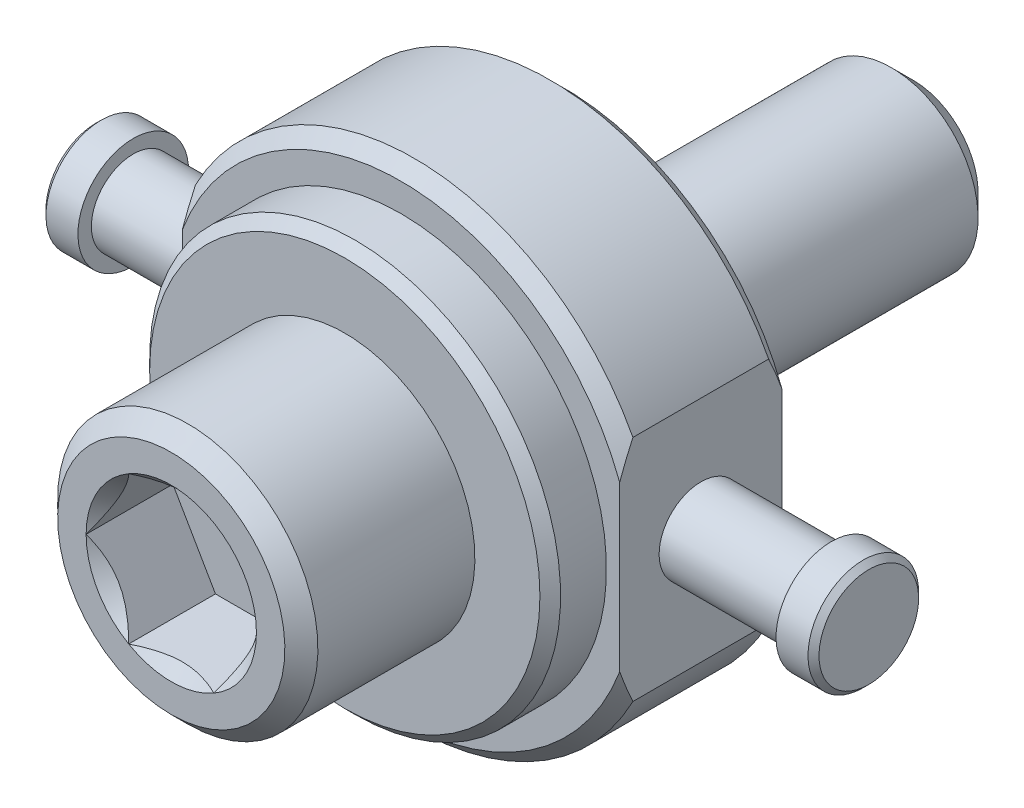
ISO-10303-21;
HEADER;
FILE_DESCRIPTION(('STEP AP214'),'2;1');
FILE_NAME('part.step','',(''),(''),'','','');
FILE_SCHEMA(('AUTOMOTIVE_DESIGN { 1 0 10303 214 1 1 1 1 }'));
ENDSEC;
DATA;
#1=APPLICATION_CONTEXT('core data for automotive mechanical design processes');
#2=APPLICATION_PROTOCOL_DEFINITION('international standard','automotive_design',2000,#1);
#3=PRODUCT_CONTEXT('',#1,'mechanical');
#4=PRODUCT('Part','Part','',(#3));
#5=PRODUCT_RELATED_PRODUCT_CATEGORY('part','',(#4));
#6=PRODUCT_DEFINITION_FORMATION('','',#4);
#7=PRODUCT_DEFINITION_CONTEXT('part definition',#1,'design');
#8=PRODUCT_DEFINITION('design','',#6,#7);
#9=PRODUCT_DEFINITION_SHAPE('','',#8);
#10=(LENGTH_UNIT() NAMED_UNIT(*) SI_UNIT(.MILLI.,.METRE.));
#11=(NAMED_UNIT(*) PLANE_ANGLE_UNIT() SI_UNIT($,.RADIAN.));
#12=(NAMED_UNIT(*) SI_UNIT($,.STERADIAN.) SOLID_ANGLE_UNIT());
#13=UNCERTAINTY_MEASURE_WITH_UNIT(LENGTH_MEASURE(1.E-05),#10,'distance_accuracy_value','');
#14=(GEOMETRIC_REPRESENTATION_CONTEXT(3) GLOBAL_UNCERTAINTY_ASSIGNED_CONTEXT((#13)) GLOBAL_UNIT_ASSIGNED_CONTEXT((#10,
#11,#12)) REPRESENTATION_CONTEXT('',''));
#15=CARTESIAN_POINT('',(0.,0.,0.));
#16=DIRECTION('',(0.,0.,1.));
#17=DIRECTION('',(1.,0.,0.));
#18=AXIS2_PLACEMENT_3D('',#15,#16,#17);
#19=CARTESIAN_POINT('',(-40.2336,6.4519048,9.1944952));
#20=DIRECTION('',(-1.,0.,0.));
#21=DIRECTION('',(0.,-1.,0.));
#22=AXIS2_PLACEMENT_3D('',#19,#20,#21);
#23=PLANE('',#22);
#24=CARTESIAN_POINT('',(-40.2336,0.,15.6464));
#25=DIRECTION('',(1.,0.,0.));
#26=DIRECTION('',(0.,1.,0.));
#27=AXIS2_PLACEMENT_3D('',#24,#25,#26);
#28=CIRCLE('',#27,6.3754);
#29=CARTESIAN_POINT('',(-40.2336,6.3754,15.6464));
#30=VERTEX_POINT('',#29);
#31=EDGE_CURVE('E340',#30,#30,#28,.F.);
#32=ORIENTED_EDGE('',*,*,#31,.F.);
#33=EDGE_LOOP('',(#32));
#34=FACE_BOUND('',#33,.T.);
#35=CARTESIAN_POINT('',(-40.2336,0.,15.6464));
#36=DIRECTION('',(1.,0.,0.));
#37=DIRECTION('',(0.,1.,0.));
#38=AXIS2_PLACEMENT_3D('',#35,#36,#37);
#39=CIRCLE('',#38,4.826);
#40=CARTESIAN_POINT('',(-40.2336,4.826,15.6464));
#41=VERTEX_POINT('',#40);
#42=EDGE_CURVE('E321',#41,#41,#39,.F.);
#43=ORIENTED_EDGE('',*,*,#42,.T.);
#44=EDGE_LOOP('',(#43));
#45=FACE_BOUND('',#44,.T.);
#46=ADVANCED_FACE('F14',(#34,#45),#23,.F.);
#47=CARTESIAN_POINT('',(40.2336,-6.4519048,9.1944952));
#48=DIRECTION('',(1.,0.,0.));
#49=DIRECTION('',(0.,1.,0.));
#50=AXIS2_PLACEMENT_3D('',#47,#48,#49);
#51=PLANE('',#50);
#52=CARTESIAN_POINT('',(40.2336,0.,15.6464));
#53=DIRECTION('',(1.,0.,0.));
#54=DIRECTION('',(0.,1.,0.));
#55=AXIS2_PLACEMENT_3D('',#52,#53,#54);
#56=CIRCLE('',#55,6.3754);
#57=CARTESIAN_POINT('',(40.2336,6.3754,15.6464));
#58=VERTEX_POINT('',#57);
#59=EDGE_CURVE('E23',#58,#58,#56,.T.);
#60=ORIENTED_EDGE('',*,*,#59,.F.);
#61=EDGE_LOOP('',(#60));
#62=FACE_BOUND('',#61,.T.);
#63=CARTESIAN_POINT('',(40.2336,0.,15.6464));
#64=DIRECTION('',(1.,0.,0.));
#65=DIRECTION('',(0.,1.,0.));
#66=AXIS2_PLACEMENT_3D('',#63,#64,#65);
#67=CIRCLE('',#66,4.826);
#68=CARTESIAN_POINT('',(40.2336,4.826,15.6464));
#69=VERTEX_POINT('',#68);
#70=EDGE_CURVE('E318',#69,#69,#67,.T.);
#71=ORIENTED_EDGE('',*,*,#70,.T.);
#72=EDGE_LOOP('',(#71));
#73=FACE_BOUND('',#72,.T.);
#74=ADVANCED_FACE('F494',(#62,#73),#51,.F.);
#75=CARTESIAN_POINT('',(9.8149545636,8.4999999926,41.4959999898));
#76=DIRECTION('',(0.,0.,-1.));
#77=DIRECTION('',(0.,-1.,0.));
#78=AXIS2_PLACEMENT_3D('',#75,#76,#77);
#79=PLANE('',#78);
#80=DIRECTION('',(-1.,0.,0.));
#81=VECTOR('',#80,1.);
#82=CARTESIAN_POINT('',(0.,8.4999999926,41.4959999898));
#83=LINE('',#82,#81);
#84=CARTESIAN_POINT('',(4.9074772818,8.4999999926,41.4959999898));
#85=VERTEX_POINT('',#84);
#86=CARTESIAN_POINT('',(-4.9074772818,8.4999999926,41.4959999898));
#87=VERTEX_POINT('',#86);
#88=EDGE_CURVE('E104',#85,#87,#83,.T.);
#89=ORIENTED_EDGE('',*,*,#88,.T.);
#90=DIRECTION('',(-0.499999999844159,-0.866025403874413,0.));
#91=VECTOR('',#90,1.);
#92=CARTESIAN_POINT('',(-7.3612159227,4.2499999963,41.4959999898));
#93=LINE('',#92,#91);
#94=CARTESIAN_POINT('',(-9.8149545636,0.,41.4959999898));
#95=VERTEX_POINT('',#94);
#96=EDGE_CURVE('E390',#87,#95,#93,.T.);
#97=ORIENTED_EDGE('',*,*,#96,.T.);
#98=DIRECTION('',(0.499999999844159,-0.866025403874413,0.));
#99=VECTOR('',#98,1.);
#100=CARTESIAN_POINT('',(-7.3612159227,-4.2499999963,41.4959999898));
#101=LINE('',#100,#99);
#102=CARTESIAN_POINT('',(-4.9074772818,-8.4999999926,41.4959999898));
#103=VERTEX_POINT('',#102);
#104=EDGE_CURVE('E444',#95,#103,#101,.T.);
#105=ORIENTED_EDGE('',*,*,#104,.T.);
#106=DIRECTION('',(1.,0.,0.));
#107=VECTOR('',#106,1.);
#108=CARTESIAN_POINT('',(0.,-8.4999999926,41.4959999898));
#109=LINE('',#108,#107);
#110=CARTESIAN_POINT('',(4.9074772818,-8.4999999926,41.4959999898));
#111=VERTEX_POINT('',#110);
#112=EDGE_CURVE('E447',#103,#111,#109,.T.);
#113=ORIENTED_EDGE('',*,*,#112,.T.);
#114=DIRECTION('',(0.499999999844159,0.866025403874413,0.));
#115=VECTOR('',#114,1.);
#116=CARTESIAN_POINT('',(7.3612159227,-4.2499999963,41.4959999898));
#117=LINE('',#116,#115);
#118=CARTESIAN_POINT('',(9.8149545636,0.,41.4959999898));
#119=VERTEX_POINT('',#118);
#120=EDGE_CURVE('E458',#111,#119,#117,.T.);
#121=ORIENTED_EDGE('',*,*,#120,.T.);
#122=DIRECTION('',(-0.499999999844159,0.866025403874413,0.));
#123=VECTOR('',#122,1.);
#124=CARTESIAN_POINT('',(7.3612159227,4.2499999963,41.4959999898));
#125=LINE('',#124,#123);
#126=EDGE_CURVE('E463',#119,#85,#125,.T.);
#127=ORIENTED_EDGE('',*,*,#126,.T.);
#128=EDGE_LOOP('',(#89,#97,#105,#113,#121,#127));
#129=FACE_BOUND('',#128,.T.);
#130=ADVANCED_FACE('F495',(#129),#79,.F.);
#131=CARTESIAN_POINT('',(-4.9074772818,-8.4999999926,41.4959999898));
#132=DIRECTION('',(0.,-1.,0.));
#133=DIRECTION('',(1.,0.,0.));
#134=AXIS2_PLACEMENT_3D('',#131,#132,#133);
#135=PLANE('',#134);
#136=DIRECTION('',(0.,0.,1.));
#137=VECTOR('',#136,1.);
#138=CARTESIAN_POINT('',(4.9074772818,-8.4999999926,46.5260000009));
#139=LINE('',#138,#137);
#140=CARTESIAN_POINT('',(4.90747728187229,-8.49999999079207,51.4960000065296));
#141=VERTEX_POINT('',#140);
#142=EDGE_CURVE('E392',#111,#141,#139,.T.);
#143=ORIENTED_EDGE('',*,*,#142,.F.);
#144=ORIENTED_EDGE('',*,*,#112,.F.);
#145=DIRECTION('',(0.,0.,1.));
#146=VECTOR('',#145,1.);
#147=CARTESIAN_POINT('',(-4.9074772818,-8.4999999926,46.5260000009));
#148=LINE('',#147,#146);
#149=CARTESIAN_POINT('',(-4.90747728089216,-8.49999999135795,51.4960000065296));
#150=VERTEX_POINT('',#149);
#151=EDGE_CURVE('E468',#103,#150,#148,.T.);
#152=ORIENTED_EDGE('',*,*,#151,.T.);
#153=CARTESIAN_POINT('',(4.90747727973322,-8.4999999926,51.4960000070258));
#154=CARTESIAN_POINT('',(4.7387384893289,-8.4999999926,51.411646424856));
#155=CARTESIAN_POINT('',(4.56868293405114,-8.4999999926,51.3298674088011));
#156=CARTESIAN_POINT('',(4.22572327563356,-8.4999999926,51.1722751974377));
#157=CARTESIAN_POINT('',(4.05281767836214,-8.4999999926,51.0964652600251));
#158=CARTESIAN_POINT('',(3.70312744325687,-8.4999999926,50.9513068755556));
#159=CARTESIAN_POINT('',(3.52632626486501,-8.4999999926,50.8819979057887));
#160=CARTESIAN_POINT('',(3.16985807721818,-8.4999999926,50.7513513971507));
#161=CARTESIAN_POINT('',(2.99019151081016,-8.4999999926,50.6900126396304));
#162=CARTESIAN_POINT('',(2.45252360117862,-8.4999999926,50.5213289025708));
#163=CARTESIAN_POINT('',(2.0902301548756,-8.4999999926,50.4269189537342));
#164=CARTESIAN_POINT('',(1.54090790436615,-8.4999999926,50.3177210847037));
#165=CARTESIAN_POINT('',(1.35700387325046,-8.4999999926,50.2867392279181));
#166=CARTESIAN_POINT('',(0.987632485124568,-8.4999999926,50.2362758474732));
#167=CARTESIAN_POINT('',(0.802165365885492,-8.4999999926,50.216792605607));
#168=CARTESIAN_POINT('',(0.350193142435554,-8.4999999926,50.1841254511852));
#169=CARTESIAN_POINT('',(0.0832017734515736,-8.4999999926,50.1772724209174));
#170=CARTESIAN_POINT('',(-0.450300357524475,-8.4999999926,50.1887815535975));
#171=CARTESIAN_POINT('',(-0.716810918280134,-8.4999999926,50.2071525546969));
#172=CARTESIAN_POINT('',(-1.24731902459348,-8.4999999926,50.2680270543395));
#173=CARTESIAN_POINT('',(-1.5113134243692,-8.4999999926,50.3105575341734));
#174=CARTESIAN_POINT('',(-2.03476479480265,-8.4999999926,50.417438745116));
#175=CARTESIAN_POINT('',(-2.2942221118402,-8.4999999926,50.4817878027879));
#176=CARTESIAN_POINT('',(-2.75477375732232,-8.4999999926,50.6141639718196));
#177=CARTESIAN_POINT('',(-2.95688850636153,-8.4999999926,50.6787076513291));
#178=CARTESIAN_POINT('',(-3.35749037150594,-8.4999999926,50.8181945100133));
#179=CARTESIAN_POINT('',(-3.55597737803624,-8.4999999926,50.8931380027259));
#180=CARTESIAN_POINT('',(-3.94869853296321,-8.4999999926,51.0517449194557));
#181=CARTESIAN_POINT('',(-4.14294384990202,-8.4999999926,51.1353809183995));
#182=CARTESIAN_POINT('',(-4.52783818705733,-8.4999999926,51.310275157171));
#183=CARTESIAN_POINT('',(-4.71848932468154,-8.4999999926,51.4015287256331));
#184=CARTESIAN_POINT('',(-4.90747727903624,-8.4999999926,51.4960000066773));
#185=B_SPLINE_CURVE_WITH_KNOTS('',3,(#153,#154,#155,#156,#157,#158,#159,#160,#161,#162,#163,
#164,#165,#166,#167,#168,#169,#170,#171,#172,#173,#174,#175,#176,#177,#178,#179,#180,#181,#182,
#183,#184),.UNSPECIFIED.,.F.,.F.,(4,2,2,2,2,2,2,2,2,2,2,2,2,2,2,4),(0.,0.565961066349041,
1.13222892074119,1.70173870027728,2.2711612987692,3.3917314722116,3.95091782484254,
4.51002059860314,5.31001543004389,6.11029064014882,6.91146135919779,7.71257064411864,
8.34878318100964,8.98501490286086,9.61929695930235,10.2531928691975),.UNSPECIFIED.);
#186=EDGE_CURVE('E369',#141,#150,#185,.T.);
#187=ORIENTED_EDGE('',*,*,#186,.F.);
#188=EDGE_LOOP('',(#143,#144,#152,#187));
#189=FACE_BOUND('',#188,.T.);
#190=ADVANCED_FACE('F499',(#189),#135,.F.);
#191=CARTESIAN_POINT('',(4.9074772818,-8.4999999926,41.4959999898));
#192=DIRECTION('',(0.866025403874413,-0.499999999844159,0.));
#193=DIRECTION('',(0.499999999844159,0.866025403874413,0.));
#194=AXIS2_PLACEMENT_3D('',#191,#192,#193);
#195=PLANE('',#194);
#196=DIRECTION('',(0.,0.,1.));
#197=VECTOR('',#196,1.);
#198=CARTESIAN_POINT('',(9.8149545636,0.,46.5260000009));
#199=LINE('',#198,#197);
#200=CARTESIAN_POINT('',(9.81495456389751,-3.66026586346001E-10,51.4960000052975));
#201=VERTEX_POINT('',#200);
#202=EDGE_CURVE('E114',#119,#201,#199,.T.);
#203=ORIENTED_EDGE('',*,*,#202,.F.);
#204=ORIENTED_EDGE('',*,*,#120,.F.);
#205=ORIENTED_EDGE('',*,*,#142,.T.);
#206=CARTESIAN_POINT('',(9.81495456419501,1.03058713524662E-09,51.496000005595));
#207=CARTESIAN_POINT('',(9.73058516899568,-0.146132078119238,51.4116464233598));
#208=CARTESIAN_POINT('',(9.64555739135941,-0.293404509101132,51.3298674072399));
#209=CARTESIAN_POINT('',(9.47407756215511,-0.59041628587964,51.172275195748));
#210=CARTESIAN_POINT('',(9.38762476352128,-0.740156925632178,51.0964652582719));
#211=CARTESIAN_POINT('',(9.21277964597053,-1.0429975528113,50.9513068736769));
#212=CARTESIAN_POINT('',(9.12437905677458,-1.19611186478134,50.881997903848));
#213=CARTESIAN_POINT('',(8.94614496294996,-1.50482237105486,50.7513513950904));
#214=CARTESIAN_POINT('',(8.85631167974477,-1.66041818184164,50.6900126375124));
#215=CARTESIAN_POINT('',(8.58747772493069,-2.1260522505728,50.5213289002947));
#216=CARTESIAN_POINT('',(8.40633100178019,-2.43980757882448,50.4269189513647));
#217=CARTESIAN_POINT('',(8.13166987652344,-2.9155346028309,50.3177210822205));
#218=CARTESIAN_POINT('',(8.03971786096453,-3.07480016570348,50.2867392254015));
#219=CARTESIAN_POINT('',(7.8550321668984,-3.39468517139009,50.2362758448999));
#220=CARTESIAN_POINT('',(7.76229860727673,-3.55530440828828,50.2167926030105));
#221=CARTESIAN_POINT('',(7.53631249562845,-3.9467238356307,50.1841254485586));
#222=CARTESIAN_POINT('',(7.40281681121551,-4.17794514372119,50.1772724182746));
#223=CARTESIAN_POINT('',(7.13606574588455,-4.63997154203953,50.1887815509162));
#224=CARTESIAN_POINT('',(7.00281046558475,-4.87077645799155,50.2071525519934));
#225=CARTESIAN_POINT('',(6.73755641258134,-5.33020995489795,50.2680270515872));
#226=CARTESIAN_POINT('',(6.60555921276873,-5.55883581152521,50.3105575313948));
#227=CARTESIAN_POINT('',(6.34383352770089,-6.01215799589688,50.4174387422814));
#228=CARTESIAN_POINT('',(6.21410486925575,-6.23685462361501,50.4817877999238));
#229=CARTESIAN_POINT('',(5.98382904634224,-6.63570404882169,50.6141639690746));
#230=CARTESIAN_POINT('',(5.88277167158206,-6.81074055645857,50.6787076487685));
#231=CARTESIAN_POINT('',(5.68247073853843,-7.15767194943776,50.8181945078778));
#232=CARTESIAN_POINT('',(5.58322723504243,-7.32956673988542,50.8931380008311));
#233=CARTESIAN_POINT('',(5.38686665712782,-7.66967323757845,51.0517449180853));
#234=CARTESIAN_POINT('',(5.28974399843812,-7.8378946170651,51.1353809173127));
#235=CARTESIAN_POINT('',(5.09729682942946,-8.1712228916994,51.3102751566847));
#236=CARTESIAN_POINT('',(5.00197126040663,-8.33633162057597,51.4015287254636));
#237=CARTESIAN_POINT('',(4.90747728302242,-8.49999999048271,51.4960000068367));
#238=B_SPLINE_CURVE_WITH_KNOTS('',3,(#206,#207,#208,#209,#210,#211,#212,#213,#214,#215,#216,
#217,#218,#219,#220,#221,#222,#223,#224,#225,#226,#227,#228,#229,#230,#231,#232,#233,#234,#235,
#236,#237),.UNSPECIFIED.,.F.,.F.,(4,2,2,2,2,2,2,2,2,2,2,2,2,2,2,4),(0.,0.565961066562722,
1.13222892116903,1.70173870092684,2.27116129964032,3.39173147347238,3.95091782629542,
4.51002060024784,5.31001543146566,6.11029064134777,6.91146136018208,7.71257064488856,
8.34878318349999,8.98501490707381,9.61929696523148,10.2531928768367),.UNSPECIFIED.);
#239=EDGE_CURVE('E119',#201,#141,#238,.T.);
#240=ORIENTED_EDGE('',*,*,#239,.F.);
#241=EDGE_LOOP('',(#203,#204,#205,#240));
#242=FACE_BOUND('',#241,.T.);
#243=ADVANCED_FACE('F534',(#242),#195,.F.);
#244=CARTESIAN_POINT('',(9.8149545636,0.,41.4959999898));
#245=DIRECTION('',(0.866025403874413,0.499999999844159,0.));
#246=DIRECTION('',(-0.499999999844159,0.866025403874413,0.));
#247=AXIS2_PLACEMENT_3D('',#244,#245,#246);
#248=PLANE('',#247);
#249=DIRECTION('',(0.,0.,1.));
#250=VECTOR('',#249,1.);
#251=CARTESIAN_POINT('',(4.9074772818,8.4999999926,46.5260000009));
#252=LINE('',#251,#250);
#253=CARTESIAN_POINT('',(4.90747728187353,8.49999999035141,51.4960000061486));
#254=VERTEX_POINT('',#253);
#255=EDGE_CURVE('E100',#85,#254,#252,.T.);
#256=ORIENTED_EDGE('',*,*,#255,.F.);
#257=ORIENTED_EDGE('',*,*,#126,.F.);
#258=ORIENTED_EDGE('',*,*,#202,.T.);
#259=CARTESIAN_POINT('',(4.9074772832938,8.49999999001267,51.4960000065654));
#260=CARTESIAN_POINT('',(4.99184667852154,8.35386791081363,51.4116464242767));
#261=CARTESIAN_POINT('',(5.07687445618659,8.2065954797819,51.3298674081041));
#262=CARTESIAN_POINT('',(5.24835428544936,7.9095837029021,51.1722751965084));
#263=CARTESIAN_POINT('',(5.33480708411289,7.75984306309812,51.0964652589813));
#264=CARTESIAN_POINT('',(5.50965220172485,7.457002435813,50.9513068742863));
#265=CARTESIAN_POINT('',(5.59805279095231,7.30388812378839,50.8819979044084));
#266=CARTESIAN_POINT('',(5.77628688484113,6.99517761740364,50.7513513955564));
#267=CARTESIAN_POINT('',(5.86612016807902,6.83958180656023,50.690012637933));
#268=CARTESIAN_POINT('',(6.13495412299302,6.373947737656,50.5213289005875));
#269=CARTESIAN_POINT('',(6.31610084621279,6.06019240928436,50.426918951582));
#270=CARTESIAN_POINT('',(6.59076197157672,5.58446538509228,50.3177210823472));
#271=CARTESIAN_POINT('',(6.68271398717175,5.42519982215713,50.2867392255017));
#272=CARTESIAN_POINT('',(6.86739968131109,5.10531481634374,50.236275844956));
#273=CARTESIAN_POINT('',(6.96013324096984,4.94469557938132,50.2167926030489));
#274=CARTESIAN_POINT('',(7.1861193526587,4.55327615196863,50.1841254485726));
#275=CARTESIAN_POINT('',(7.31961503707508,4.32205484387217,50.1772724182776));
#276=CARTESIAN_POINT('',(7.58636610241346,3.86002844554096,50.1887815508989));
#277=CARTESIAN_POINT('',(7.71962138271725,3.62922352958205,50.2071525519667));
#278=CARTESIAN_POINT('',(7.98487543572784,3.1697900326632,50.2680270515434));
#279=CARTESIAN_POINT('',(8.11687263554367,2.94116417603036,50.3105575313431));
#280=CARTESIAN_POINT('',(8.37859832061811,2.48784199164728,50.4174387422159));
#281=CARTESIAN_POINT('',(8.50832697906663,2.26314536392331,50.4817877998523));
#282=CARTESIAN_POINT('',(8.73860280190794,1.86429593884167,50.6141639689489));
#283=CARTESIAN_POINT('',(8.8396601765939,1.68925943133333,50.6787076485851));
#284=CARTESIAN_POINT('',(9.0399611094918,1.34232803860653,50.8181945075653));
#285=CARTESIAN_POINT('',(9.13920461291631,1.17043324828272,50.8931380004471));
#286=CARTESIAN_POINT('',(9.33556519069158,0.830326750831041,51.0517449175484));
#287=CARTESIAN_POINT('',(9.43268784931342,0.662105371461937,51.1353809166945));
#288=CARTESIAN_POINT('',(9.62513501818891,0.328777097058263,51.3102751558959));
#289=CARTESIAN_POINT('',(9.72046058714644,0.163668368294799,51.4015287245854));
#290=CARTESIAN_POINT('',(9.81495456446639,-1.50062258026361E-09,51.4960000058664));
#291=B_SPLINE_CURVE_WITH_KNOTS('',3,(#259,#260,#261,#262,#263,#264,#265,#266,#267,#268,#269,
#270,#271,#272,#273,#274,#275,#276,#277,#278,#279,#280,#281,#282,#283,#284,#285,#286,#287,#288,
#289,#290),.UNSPECIFIED.,.F.,.F.,(4,2,2,2,2,2,2,2,2,2,2,2,2,2,2,4),(0.,0.56596106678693,
1.13222892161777,1.70173870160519,2.27116130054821,3.39173147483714,3.95091782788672,
4.51002060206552,5.31001543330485,6.11029064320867,6.91146136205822,7.71257064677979,
8.3487831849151,8.98501490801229,9.61929696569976,10.2531928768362),.UNSPECIFIED.);
#292=EDGE_CURVE('E111',#254,#201,#291,.T.);
#293=ORIENTED_EDGE('',*,*,#292,.F.);
#294=EDGE_LOOP('',(#256,#257,#258,#293));
#295=FACE_BOUND('',#294,.T.);
#296=ADVANCED_FACE('F112',(#295),#248,.F.);
#297=CARTESIAN_POINT('',(4.9074772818,8.4999999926,41.4959999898));
#298=DIRECTION('',(0.,1.,0.));
#299=DIRECTION('',(-1.,0.,0.));
#300=AXIS2_PLACEMENT_3D('',#297,#298,#299);
#301=PLANE('',#300);
#302=DIRECTION('',(0.,0.,-1.));
#303=VECTOR('',#302,1.);
#304=CARTESIAN_POINT('',(-4.9074772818,8.4999999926,46.5260000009));
#305=LINE('',#304,#303);
#306=CARTESIAN_POINT('',(-4.90747728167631,8.49999998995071,51.496000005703));
#307=VERTEX_POINT('',#306);
#308=EDGE_CURVE('E108',#307,#87,#305,.T.);
#309=ORIENTED_EDGE('',*,*,#308,.T.);
#310=ORIENTED_EDGE('',*,*,#88,.F.);
#311=ORIENTED_EDGE('',*,*,#255,.T.);
#312=CARTESIAN_POINT('',(-4.90747727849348,8.4999999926,51.4960000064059));
#313=CARTESIAN_POINT('',(-4.73873849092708,8.4999999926,51.411646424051));
#314=CARTESIAN_POINT('',(-4.56868293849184,8.4999999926,51.3298674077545));
#315=CARTESIAN_POINT('',(-4.22572328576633,8.4999999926,51.1722751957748));
#316=CARTESIAN_POINT('',(-4.05281769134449,8.4999999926,51.0964652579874));
#317=CARTESIAN_POINT('',(-3.70312746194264,8.4999999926,50.9513068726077));
#318=CARTESIAN_POINT('',(-3.52632628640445,8.4999999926,50.8819979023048));
#319=CARTESIAN_POINT('',(-3.16985810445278,8.4999999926,50.7513513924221));
#320=CARTESIAN_POINT('',(-2.99019154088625,8.4999999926,50.6900126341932));
#321=CARTESIAN_POINT('',(-2.45252363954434,8.4999999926,50.5213288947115));
#322=CARTESIAN_POINT('',(-2.0902301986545,8.4999999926,50.4269189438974));
#323=CARTESIAN_POINT('',(-1.54090795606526,8.4999999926,50.3177210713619));
#324=CARTESIAN_POINT('',(-1.35700392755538,8.4999999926,50.2867392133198));
#325=CARTESIAN_POINT('',(-0.98763254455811,8.4999999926,50.2362758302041));
#326=CARTESIAN_POINT('',(-0.802165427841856,8.4999999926,50.2167925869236));
#327=CARTESIAN_POINT('',(-0.35019321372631,8.4999999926,50.184125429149));
#328=CARTESIAN_POINT('',(-0.0832018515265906,8.4999999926,50.1772723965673));
#329=CARTESIAN_POINT('',(0.450300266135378,8.4999999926,50.1887815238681));
#330=CARTESIAN_POINT('',(0.716810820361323,8.4999999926,50.2071525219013));
#331=CARTESIAN_POINT('',(1.24731891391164,8.4999999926,50.2680270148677));
#332=CARTESIAN_POINT('',(1.51131330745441,8.4999999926,50.3105574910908));
#333=CARTESIAN_POINT('',(2.03476466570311,8.4999999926,50.4174386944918));
#334=CARTESIAN_POINT('',(2.29422197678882,8.4999999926,50.4817877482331));
#335=CARTESIAN_POINT('',(2.7547736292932,8.4999999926,50.6141639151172));
#336=CARTESIAN_POINT('',(2.95688839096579,8.4999999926,50.6787075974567));
#337=CARTESIAN_POINT('',(3.35749028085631,8.4999999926,50.8181944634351));
#338=CARTESIAN_POINT('',(3.55597729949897,8.4999999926,50.8931379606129));
#339=CARTESIAN_POINT('',(3.94869847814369,8.4999999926,51.0517448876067));
#340=CARTESIAN_POINT('',(4.14294380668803,8.4999999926,51.135380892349));
#341=CARTESIAN_POINT('',(4.52783816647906,8.4999999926,51.3102751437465));
#342=CARTESIAN_POINT('',(4.71848931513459,8.4999999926,51.4015287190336));
#343=CARTESIAN_POINT('',(4.90747728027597,8.4999999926,51.4960000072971));
#344=B_SPLINE_CURVE_WITH_KNOTS('',3,(#312,#313,#314,#315,#316,#317,#318,#319,#320,#321,#322,
#323,#324,#325,#326,#327,#328,#329,#330,#331,#332,#333,#334,#335,#336,#337,#338,#339,#340,#341,
#342,#343),.UNSPECIFIED.,.F.,.F.,(4,2,2,2,2,2,2,2,2,2,2,2,2,2,2,4),(0.,0.565961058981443,
1.13222890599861,1.70173867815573,2.2711612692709,3.39173142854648,3.95091777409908,
4.51002054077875,5.31001535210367,6.11029054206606,6.91146124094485,7.71257050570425,
8.34878308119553,8.98501484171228,9.6192969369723,10.2531928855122),.UNSPECIFIED.);
#345=EDGE_CURVE('E96',#307,#254,#344,.T.);
#346=ORIENTED_EDGE('',*,*,#345,.F.);
#347=EDGE_LOOP('',(#309,#310,#311,#346));
#348=FACE_BOUND('',#347,.T.);
#349=ADVANCED_FACE('F102',(#348),#301,.F.);
#350=CARTESIAN_POINT('',(-4.9074772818,8.4999999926,41.4959999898));
#351=DIRECTION('',(-0.866025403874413,0.499999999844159,0.));
#352=DIRECTION('',(-0.499999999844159,-0.866025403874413,0.));
#353=AXIS2_PLACEMENT_3D('',#350,#351,#352);
#354=PLANE('',#353);
#355=DIRECTION('',(0.,0.,1.));
#356=VECTOR('',#355,1.);
#357=CARTESIAN_POINT('',(-9.8149545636,0.,46.5260000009));
#358=LINE('',#357,#356);
#359=CARTESIAN_POINT('',(-9.81495456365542,-1.91709925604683E-09,51.4960000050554));
#360=VERTEX_POINT('',#359);
#361=EDGE_CURVE('E107',#95,#360,#358,.T.);
#362=ORIENTED_EDGE('',*,*,#361,.F.);
#363=ORIENTED_EDGE('',*,*,#96,.F.);
#364=ORIENTED_EDGE('',*,*,#308,.F.);
#365=CARTESIAN_POINT('',(-9.81495456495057,-2.33924942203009E-09,51.4960000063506));
#366=CARTESIAN_POINT('',(-9.73058516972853,0.146132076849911,51.4116464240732));
#367=CARTESIAN_POINT('',(-9.64555739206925,0.293404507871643,51.3298674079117));
#368=CARTESIAN_POINT('',(-9.47407756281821,0.590416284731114,51.1722751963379));
#369=CARTESIAN_POINT('',(-9.38762476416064,0.740156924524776,51.0964652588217));
#370=CARTESIAN_POINT('',(-9.21277964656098,1.0429975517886,50.951306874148));
#371=CARTESIAN_POINT('',(-9.12437905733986,1.19611186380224,50.8819979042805));
#372=CARTESIAN_POINT('',(-8.94614496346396,1.5048223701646,50.7513513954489));
#373=CARTESIAN_POINT('',(-8.85631168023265,1.6604181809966,50.6900126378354));
#374=CARTESIAN_POINT('',(-8.58747772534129,2.12605224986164,50.5213289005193));
#375=CARTESIAN_POINT('',(-8.40633100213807,2.4398075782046,50.4269189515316));
#376=CARTESIAN_POINT('',(-8.13166987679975,2.91553460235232,50.317721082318));
#377=CARTESIAN_POINT('',(-8.03971786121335,3.07480016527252,50.2867392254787));
#378=CARTESIAN_POINT('',(-7.8550321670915,3.39468517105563,50.2362758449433));
#379=CARTESIAN_POINT('',(-7.76229860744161,3.55530440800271,50.2167926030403));
#380=CARTESIAN_POINT('',(-7.53631249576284,3.94672383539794,50.1841254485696));
#381=CARTESIAN_POINT('',(-7.40281681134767,4.17794514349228,50.177272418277));
#382=CARTESIAN_POINT('',(-7.13606574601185,4.63997154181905,50.1887815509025));
#383=CARTESIAN_POINT('',(-7.00281046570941,4.87077645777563,50.2071525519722));
#384=CARTESIAN_POINT('',(-6.7375564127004,5.33020995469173,50.2680270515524));
#385=CARTESIAN_POINT('',(-6.60555921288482,5.55883581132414,50.3105575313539));
#386=CARTESIAN_POINT('',(-6.34383352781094,6.01215799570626,50.41743874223));
#387=CARTESIAN_POINT('',(-6.21410486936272,6.23685462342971,50.4817877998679));
#388=CARTESIAN_POINT('',(-5.98382904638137,6.63570404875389,50.6141639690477));
#389=CARTESIAN_POINT('',(-5.8827716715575,6.81074055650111,50.6787076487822));
#390=CARTESIAN_POINT('',(-5.68247073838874,7.15767194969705,50.8181945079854));
#391=CARTESIAN_POINT('',(-5.58322723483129,7.32956674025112,50.893138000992));
#392=CARTESIAN_POINT('',(-5.38686665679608,7.66967323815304,51.0517449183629));
#393=CARTESIAN_POINT('',(-5.2897439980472,7.83789461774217,51.1353809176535));
#394=CARTESIAN_POINT('',(-5.09729682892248,8.17122289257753,51.3102751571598));
#395=CARTESIAN_POINT('',(-5.00197125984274,8.33633162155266,51.4015287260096));
#396=CARTESIAN_POINT('',(-4.90747728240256,8.49999999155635,51.4960000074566));
#397=B_SPLINE_CURVE_WITH_KNOTS('',3,(#365,#366,#367,#368,#369,#370,#371,#372,#373,#374,#375,
#376,#377,#378,#379,#380,#381,#382,#383,#384,#385,#386,#387,#388,#389,#390,#391,#392,#393,#394,
#395,#396),.UNSPECIFIED.,.F.,.F.,(4,2,2,2,2,2,2,2,2,2,2,2,2,2,2,4),(0.,0.565961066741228,
1.13222892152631,1.70173870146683,2.27116130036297,3.39173147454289,3.95091782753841,
4.5100206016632,5.31001543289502,6.11029064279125,6.91146136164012,7.71257064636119,
8.34878318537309,8.98501490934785,9.61929696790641,10.2531928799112),.UNSPECIFIED.);
#398=EDGE_CURVE('E127',#360,#307,#397,.T.);
#399=ORIENTED_EDGE('',*,*,#398,.F.);
#400=EDGE_LOOP('',(#362,#363,#364,#399));
#401=FACE_BOUND('',#400,.T.);
#402=ADVANCED_FACE('F162',(#401),#354,.F.);
#403=CARTESIAN_POINT('',(-9.8149545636,0.,41.4959999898));
#404=DIRECTION('',(-0.866025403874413,-0.499999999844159,0.));
#405=DIRECTION('',(0.499999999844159,-0.866025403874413,0.));
#406=AXIS2_PLACEMENT_3D('',#403,#404,#405);
#407=PLANE('',#406);
#408=ORIENTED_EDGE('',*,*,#151,.F.);
#409=ORIENTED_EDGE('',*,*,#104,.F.);
#410=ORIENTED_EDGE('',*,*,#361,.T.);
#411=CARTESIAN_POINT('',(-4.90747728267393,-8.49999999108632,51.4960000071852));
#412=CARTESIAN_POINT('',(-4.99184667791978,-8.35386791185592,51.4116464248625));
#413=CARTESIAN_POINT('',(-5.07687445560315,-8.20659548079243,51.3298674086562));
#414=CARTESIAN_POINT('',(-5.24835428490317,-7.90958370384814,51.1722751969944));
#415=CARTESIAN_POINT('',(-5.3348070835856,-7.7598430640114,51.0964652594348));
#416=CARTESIAN_POINT('',(-5.50965220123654,-7.45700243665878,50.951306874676));
#417=CARTESIAN_POINT('',(-5.59805279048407,-7.3038881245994,50.8819979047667));
#418=CARTESIAN_POINT('',(-5.77628688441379,-6.99517761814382,50.7513513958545));
#419=CARTESIAN_POINT('',(-5.86612016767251,-6.83958180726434,50.6900126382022));
#420=CARTESIAN_POINT('',(-6.13495412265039,-6.37394773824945,50.5213289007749));
#421=CARTESIAN_POINT('',(-6.31610084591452,-6.06019240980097,50.4269189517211));
#422=CARTESIAN_POINT('',(-6.59076197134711,-5.58446538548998,50.3177210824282));
#423=CARTESIAN_POINT('',(-6.68271398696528,-5.42519982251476,50.2867392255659));
#424=CARTESIAN_POINT('',(-6.86739968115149,-5.10531481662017,50.2362758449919));
#425=CARTESIAN_POINT('',(-6.96013324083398,-4.94469557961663,50.2167926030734));
#426=CARTESIAN_POINT('',(-7.18611935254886,-4.55327615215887,50.1841254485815));
#427=CARTESIAN_POINT('',(-7.3196150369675,-4.32205484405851,50.1772724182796));
#428=CARTESIAN_POINT('',(-7.58636610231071,-3.86002844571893,50.1887815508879));
#429=CARTESIAN_POINT('',(-7.71962138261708,-3.62922352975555,50.2071525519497));
#430=CARTESIAN_POINT('',(-7.98487543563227,-3.16979003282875,50.2680270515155));
#431=CARTESIAN_POINT('',(-8.11687263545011,-2.94116417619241,50.3105575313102));
#432=CARTESIAN_POINT('',(-8.37859832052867,-2.48784199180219,50.4174387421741));
#433=CARTESIAN_POINT('',(-8.5083269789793,-2.26314536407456,50.4817877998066));
#434=CARTESIAN_POINT('',(-8.73860280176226,-1.864295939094,50.6141639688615));
#435=CARTESIAN_POINT('',(-8.83966017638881,-1.68925943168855,50.6787076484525));
#436=CARTESIAN_POINT('',(-9.03996110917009,-1.34232803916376,50.818194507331));
#437=CARTESIAN_POINT('',(-9.13920461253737,-1.17043324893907,50.8931380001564));
#438=CARTESIAN_POINT('',(-9.33556519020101,-0.830326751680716,51.0517449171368));
#439=CARTESIAN_POINT('',(-9.43268784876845,-0.662105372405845,51.1353809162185));
#440=CARTESIAN_POINT('',(-9.6251350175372,-0.328777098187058,51.3102751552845));
#441=CARTESIAN_POINT('',(-9.72046058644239,-0.163668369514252,51.4015287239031));
#442=CARTESIAN_POINT('',(-9.81495456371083,1.91961603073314E-10,51.4960000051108));
#443=B_SPLINE_CURVE_WITH_KNOTS('',3,(#411,#412,#413,#414,#415,#416,#417,#418,#419,#420,#421,
#422,#423,#424,#425,#426,#427,#428,#429,#430,#431,#432,#433,#434,#435,#436,#437,#438,#439,#440,
#441,#442),.UNSPECIFIED.,.F.,.F.,(4,2,2,2,2,2,2,2,2,2,2,2,2,2,2,4),(0.,0.565961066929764,
1.13222892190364,1.70173870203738,2.27116130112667,3.39173147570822,3.95091782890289,
4.51002060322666,5.31001543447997,6.11029064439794,6.91146136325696,7.7125706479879,
8.34878318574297,8.98501490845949,9.61929696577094,10.2531928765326),.UNSPECIFIED.);
#444=EDGE_CURVE('E154',#150,#360,#443,.T.);
#445=ORIENTED_EDGE('',*,*,#444,.F.);
#446=EDGE_LOOP('',(#408,#409,#410,#445));
#447=FACE_BOUND('',#446,.T.);
#448=ADVANCED_FACE('F539',(#447),#407,.F.);
#449=CARTESIAN_POINT('',(0.,0.,50.1724925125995));
#450=DIRECTION('',(0.,0.,1.));
#451=DIRECTION('',(0.,1.,0.));
#452=AXIS2_PLACEMENT_3D('',#449,#450,#451);
#453=CONICAL_SURFACE('',#452,8.49144707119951,0.785398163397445);
#454=CARTESIAN_POINT('',(0.,0.,51.496000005));
#455=DIRECTION('',(0.,0.,1.));
#456=DIRECTION('',(0.,1.,0.));
#457=AXIS2_PLACEMENT_3D('',#454,#455,#456);
#458=CIRCLE('',#457,9.8149545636);
#459=EDGE_CURVE('E360',#141,#150,#458,.F.);
#460=ORIENTED_EDGE('',*,*,#459,.F.);
#461=ORIENTED_EDGE('',*,*,#186,.T.);
#462=EDGE_LOOP('',(#460,#461));
#463=FACE_BOUND('',#462,.T.);
#464=ADVANCED_FACE('F373',(#463),#453,.F.);
#465=CARTESIAN_POINT('',(0.,0.,50.1724925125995));
#466=DIRECTION('',(0.,0.,1.));
#467=DIRECTION('',(0.,1.,0.));
#468=AXIS2_PLACEMENT_3D('',#465,#466,#467);
#469=CONICAL_SURFACE('',#468,8.49144707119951,0.785398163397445);
#470=CARTESIAN_POINT('',(0.,0.,51.496000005));
#471=DIRECTION('',(0.,0.,1.));
#472=DIRECTION('',(0.,1.,0.));
#473=AXIS2_PLACEMENT_3D('',#470,#471,#472);
#474=CIRCLE('',#473,9.8149545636);
#475=EDGE_CURVE('E134',#201,#141,#474,.F.);
#476=ORIENTED_EDGE('',*,*,#475,.F.);
#477=ORIENTED_EDGE('',*,*,#239,.T.);
#478=EDGE_LOOP('',(#476,#477));
#479=FACE_BOUND('',#478,.T.);
#480=ADVANCED_FACE('F367',(#479),#469,.F.);
#481=CARTESIAN_POINT('',(0.,0.,50.1724925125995));
#482=DIRECTION('',(0.,0.,1.));
#483=DIRECTION('',(0.,1.,0.));
#484=AXIS2_PLACEMENT_3D('',#481,#482,#483);
#485=CONICAL_SURFACE('',#484,8.49144707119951,0.785398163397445);
#486=CARTESIAN_POINT('',(0.,0.,51.496000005));
#487=DIRECTION('',(0.,0.,1.));
#488=DIRECTION('',(0.,1.,0.));
#489=AXIS2_PLACEMENT_3D('',#486,#487,#488);
#490=CIRCLE('',#489,9.8149545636);
#491=EDGE_CURVE('E130',#254,#201,#490,.F.);
#492=ORIENTED_EDGE('',*,*,#491,.F.);
#493=ORIENTED_EDGE('',*,*,#292,.T.);
#494=EDGE_LOOP('',(#492,#493));
#495=FACE_BOUND('',#494,.T.);
#496=ADVANCED_FACE('F131',(#495),#485,.F.);
#497=CARTESIAN_POINT('',(0.,0.,50.173155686));
#498=DIRECTION('',(0.,0.,1.));
#499=DIRECTION('',(0.,1.,0.));
#500=AXIS2_PLACEMENT_3D('',#497,#498,#499);
#501=CONICAL_SURFACE('',#500,8.49211027,0.785398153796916);
#502=ORIENTED_EDGE('',*,*,#345,.T.);
#503=CARTESIAN_POINT('',(0.,0.,51.496000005));
#504=DIRECTION('',(0.,0.,1.));
#505=DIRECTION('',(0.,1.,0.));
#506=AXIS2_PLACEMENT_3D('',#503,#504,#505);
#507=CIRCLE('',#506,9.81495456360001);
#508=EDGE_CURVE('E125',#307,#254,#507,.F.);
#509=ORIENTED_EDGE('',*,*,#508,.F.);
#510=EDGE_LOOP('',(#502,#509));
#511=FACE_BOUND('',#510,.T.);
#512=ADVANCED_FACE('F123',(#511),#501,.F.);
#513=CARTESIAN_POINT('',(0.,0.,50.1724925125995));
#514=DIRECTION('',(0.,0.,1.));
#515=DIRECTION('',(0.,1.,0.));
#516=AXIS2_PLACEMENT_3D('',#513,#514,#515);
#517=CONICAL_SURFACE('',#516,8.49144707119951,0.785398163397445);
#518=CARTESIAN_POINT('',(0.,0.,51.496000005));
#519=DIRECTION('',(0.,0.,1.));
#520=DIRECTION('',(0.,1.,0.));
#521=AXIS2_PLACEMENT_3D('',#518,#519,#520);
#522=CIRCLE('',#521,9.81495456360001);
#523=EDGE_CURVE('E141',#360,#307,#522,.F.);
#524=ORIENTED_EDGE('',*,*,#523,.F.);
#525=ORIENTED_EDGE('',*,*,#398,.T.);
#526=EDGE_LOOP('',(#524,#525));
#527=FACE_BOUND('',#526,.T.);
#528=ADVANCED_FACE('F165',(#527),#517,.F.);
#529=CARTESIAN_POINT('',(0.,0.,50.1724925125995));
#530=DIRECTION('',(0.,0.,1.));
#531=DIRECTION('',(0.,1.,0.));
#532=AXIS2_PLACEMENT_3D('',#529,#530,#531);
#533=CONICAL_SURFACE('',#532,8.49144707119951,0.785398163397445);
#534=CARTESIAN_POINT('',(0.,0.,51.496000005));
#535=DIRECTION('',(0.,0.,1.));
#536=DIRECTION('',(0.,1.,0.));
#537=AXIS2_PLACEMENT_3D('',#534,#535,#536);
#538=CIRCLE('',#537,9.8149545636);
#539=EDGE_CURVE('E143',#150,#360,#538,.F.);
#540=ORIENTED_EDGE('',*,*,#539,.F.);
#541=ORIENTED_EDGE('',*,*,#444,.T.);
#542=EDGE_LOOP('',(#540,#541));
#543=FACE_BOUND('',#542,.T.);
#544=ADVANCED_FACE('F169',(#543),#533,.F.);
#545=CARTESIAN_POINT('',(13.252139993,-13.252139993,51.496000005));
#546=DIRECTION('',(0.,0.,1.));
#547=DIRECTION('',(0.,1.,0.));
#548=AXIS2_PLACEMENT_3D('',#545,#546,#547);
#549=PLANE('',#548);
#550=ORIENTED_EDGE('',*,*,#539,.T.);
#551=ORIENTED_EDGE('',*,*,#523,.T.);
#552=ORIENTED_EDGE('',*,*,#508,.T.);
#553=ORIENTED_EDGE('',*,*,#491,.T.);
#554=ORIENTED_EDGE('',*,*,#475,.T.);
#555=ORIENTED_EDGE('',*,*,#459,.T.);
#556=EDGE_LOOP('',(#550,#551,#552,#553,#554,#555));
#557=FACE_BOUND('',#556,.T.);
#558=CARTESIAN_POINT('',(0.,0.,51.496000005));
#559=DIRECTION('',(0.,0.,-1.));
#560=DIRECTION('',(0.,-1.,0.));
#561=AXIS2_PLACEMENT_3D('',#558,#559,#560);
#562=CIRCLE('',#561,13.0949999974);
#563=CARTESIAN_POINT('',(0.,-13.0949999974,51.496000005));
#564=VERTEX_POINT('',#563);
#565=EDGE_CURVE('E357',#564,#564,#562,.F.);
#566=ORIENTED_EDGE('',*,*,#565,.T.);
#567=EDGE_LOOP('',(#566));
#568=FACE_BOUND('',#567,.T.);
#569=ADVANCED_FACE('F138',(#557,#568),#549,.T.);
#570=CARTESIAN_POINT('',(0.,0.,51.496000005));
#571=DIRECTION('',(0.,0.,-1.));
#572=DIRECTION('',(0.,-1.,0.));
#573=AXIS2_PLACEMENT_3D('',#570,#571,#572);
#574=CONICAL_SURFACE('',#573,13.0949999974,0.785398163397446);
#575=ORIENTED_EDGE('',*,*,#565,.F.);
#576=EDGE_LOOP('',(#575));
#577=FACE_BOUND('',#576,.T.);
#578=CARTESIAN_POINT('',(0.,0.,49.591000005));
#579=DIRECTION('',(0.,0.,-1.));
#580=DIRECTION('',(0.,-1.,0.));
#581=AXIS2_PLACEMENT_3D('',#578,#579,#580);
#582=CIRCLE('',#581,14.9999999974);
#583=CARTESIAN_POINT('',(0.,-14.9999999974,49.591000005));
#584=VERTEX_POINT('',#583);
#585=EDGE_CURVE('E359',#584,#584,#582,.F.);
#586=ORIENTED_EDGE('',*,*,#585,.T.);
#587=EDGE_LOOP('',(#586));
#588=FACE_BOUND('',#587,.T.);
#589=ADVANCED_FACE('F173',(#577,#588),#574,.T.);
#590=CARTESIAN_POINT('',(0.,0.,0.));
#591=DIRECTION('',(0.,0.,-1.));
#592=DIRECTION('',(0.,-1.,0.));
#593=AXIS2_PLACEMENT_3D('',#590,#591,#592);
#594=CYLINDRICAL_SURFACE('',#593,9.9999999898);
#595=CARTESIAN_POINT('',(0.,0.,-31.4999999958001));
#596=DIRECTION('',(0.,0.,-1.));
#597=DIRECTION('',(-1.,0.,0.));
#598=AXIS2_PLACEMENT_3D('',#595,#596,#597);
#599=CIRCLE('',#598,9.9999999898);
#600=CARTESIAN_POINT('',(-9.9999999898,0.,-31.4999999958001));
#601=VERTEX_POINT('',#600);
#602=EDGE_CURVE('E339',#601,#601,#599,.F.);
#603=ORIENTED_EDGE('',*,*,#602,.T.);
#604=EDGE_LOOP('',(#603));
#605=FACE_BOUND('',#604,.T.);
#606=CARTESIAN_POINT('',(0.,0.,0.));
#607=DIRECTION('',(0.,0.,-1.));
#608=DIRECTION('',(0.,-1.,0.));
#609=AXIS2_PLACEMENT_3D('',#606,#607,#608);
#610=CIRCLE('',#609,9.9999999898);
#611=CARTESIAN_POINT('',(0.,-9.9999999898,0.));
#612=VERTEX_POINT('',#611);
#613=EDGE_CURVE('E331',#612,#612,#610,.F.);
#614=ORIENTED_EDGE('',*,*,#613,.F.);
#615=EDGE_LOOP('',(#614));
#616=FACE_BOUND('',#615,.T.);
#617=ADVANCED_FACE('F176',(#605,#616),#594,.T.);
#618=CARTESIAN_POINT('',(0.,0.,49.591000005));
#619=DIRECTION('',(0.,0.,-1.));
#620=DIRECTION('',(0.,-1.,0.));
#621=AXIS2_PLACEMENT_3D('',#618,#619,#620);
#622=CYLINDRICAL_SURFACE('',#621,14.9999999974);
#623=ORIENTED_EDGE('',*,*,#585,.F.);
#624=EDGE_LOOP('',(#623));
#625=FACE_BOUND('',#624,.T.);
#626=CARTESIAN_POINT('',(0.,0.,31.496));
#627=DIRECTION('',(0.,0.,-1.));
#628=DIRECTION('',(0.,-1.,0.));
#629=AXIS2_PLACEMENT_3D('',#626,#627,#628);
#630=CIRCLE('',#629,14.9999999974);
#631=CARTESIAN_POINT('',(0.,-14.9999999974,31.496));
#632=VERTEX_POINT('',#631);
#633=EDGE_CURVE('E330',#632,#632,#630,.T.);
#634=ORIENTED_EDGE('',*,*,#633,.F.);
#635=EDGE_LOOP('',(#634));
#636=FACE_BOUND('',#635,.T.);
#637=ADVANCED_FACE('F179',(#625,#636),#622,.T.);
#638=CARTESIAN_POINT('',(18.0736875,18.0736875,0.));
#639=DIRECTION('',(0.,0.,-1.));
#640=DIRECTION('',(0.,-1.,0.));
#641=AXIS2_PLACEMENT_3D('',#638,#639,#640);
#642=PLANE('',#641);
#643=ORIENTED_EDGE('',*,*,#613,.T.);
#644=EDGE_LOOP('',(#643));
#645=FACE_BOUND('',#644,.T.);
#646=CARTESIAN_POINT('',(0.,0.,0.));
#647=DIRECTION('',(0.,0.,1.));
#648=DIRECTION('',(0.,1.,0.));
#649=AXIS2_PLACEMENT_3D('',#646,#647,#648);
#650=CIRCLE('',#649,17.859375);
#651=CARTESIAN_POINT('',(0.,17.859375,0.));
#652=VERTEX_POINT('',#651);
#653=EDGE_CURVE('E327',#652,#652,#650,.F.);
#654=ORIENTED_EDGE('',*,*,#653,.T.);
#655=EDGE_LOOP('',(#654));
#656=FACE_BOUND('',#655,.T.);
#657=ADVANCED_FACE('F182',(#645,#656),#642,.T.);
#658=CARTESIAN_POINT('',(22.7648135,-22.7648135,31.496));
#659=DIRECTION('',(0.,0.,1.));
#660=DIRECTION('',(0.,1.,0.));
#661=AXIS2_PLACEMENT_3D('',#658,#659,#660);
#662=PLANE('',#661);
#663=ORIENTED_EDGE('',*,*,#633,.T.);
#664=EDGE_LOOP('',(#663));
#665=FACE_BOUND('',#664,.T.);
#666=CARTESIAN_POINT('',(0.,0.,31.496));
#667=DIRECTION('',(0.,0.,-1.));
#668=DIRECTION('',(0.,-1.,0.));
#669=AXIS2_PLACEMENT_3D('',#666,#667,#668);
#670=CIRCLE('',#669,22.4948750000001);
#671=CARTESIAN_POINT('',(0.,-22.4948750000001,31.496));
#672=VERTEX_POINT('',#671);
#673=EDGE_CURVE('E345',#672,#672,#670,.F.);
#674=ORIENTED_EDGE('',*,*,#673,.T.);
#675=EDGE_LOOP('',(#674));
#676=FACE_BOUND('',#675,.T.);
#677=ADVANCED_FACE('F191',(#665,#676),#662,.T.);
#678=CARTESIAN_POINT('',(0.,0.,0.));
#679=DIRECTION('',(0.,0.,1.));
#680=DIRECTION('',(0.,1.,0.));
#681=AXIS2_PLACEMENT_3D('',#678,#679,#680);
#682=CONICAL_SURFACE('',#681,17.859375,0.785398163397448);
#683=CARTESIAN_POINT('',(0.,0.,1.190625));
#684=DIRECTION('',(0.,0.,-1.));
#685=DIRECTION('',(0.,-1.,0.));
#686=AXIS2_PLACEMENT_3D('',#683,#684,#685);
#687=CIRCLE('',#686,19.05);
#688=CARTESIAN_POINT('',(0.,-19.05,1.190625));
#689=VERTEX_POINT('',#688);
#690=EDGE_CURVE('E348',#689,#689,#687,.T.);
#691=ORIENTED_EDGE('',*,*,#690,.T.);
#692=EDGE_LOOP('',(#691));
#693=FACE_BOUND('',#692,.T.);
#694=ORIENTED_EDGE('',*,*,#653,.F.);
#695=EDGE_LOOP('',(#694));
#696=FACE_BOUND('',#695,.T.);
#697=ADVANCED_FACE('F209',(#693,#696),#682,.T.);
#698=CARTESIAN_POINT('',(0.,0.,31.496));
#699=DIRECTION('',(0.,0.,-1.));
#700=DIRECTION('',(0.,-1.,0.));
#701=AXIS2_PLACEMENT_3D('',#698,#699,#700);
#702=CONICAL_SURFACE('',#701,22.494875,0.785398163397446);
#703=CARTESIAN_POINT('',(0.,0.,30.305375));
#704=DIRECTION('',(0.,0.,-1.));
#705=DIRECTION('',(0.,-1.,0.));
#706=AXIS2_PLACEMENT_3D('',#703,#704,#705);
#707=CIRCLE('',#706,23.6855);
#708=CARTESIAN_POINT('',(0.,-23.6855,30.305375));
#709=VERTEX_POINT('',#708);
#710=EDGE_CURVE('E434',#709,#709,#707,.F.);
#711=ORIENTED_EDGE('',*,*,#710,.T.);
#712=EDGE_LOOP('',(#711));
#713=FACE_BOUND('',#712,.T.);
#714=ORIENTED_EDGE('',*,*,#673,.F.);
#715=EDGE_LOOP('',(#714));
#716=FACE_BOUND('',#715,.T.);
#717=ADVANCED_FACE('F205',(#713,#716),#702,.T.);
#718=CARTESIAN_POINT('',(0.,0.,6.3246));
#719=DIRECTION('',(0.,0.,-1.));
#720=DIRECTION('',(-1.,0.,0.));
#721=AXIS2_PLACEMENT_3D('',#718,#719,#720);
#722=CYLINDRICAL_SURFACE('',#721,19.05);
#723=ORIENTED_EDGE('',*,*,#690,.F.);
#724=EDGE_LOOP('',(#723));
#725=FACE_BOUND('',#724,.T.);
#726=CARTESIAN_POINT('',(0.,0.,6.3246));
#727=DIRECTION('',(0.,0.,-1.));
#728=DIRECTION('',(-1.,0.,0.));
#729=AXIS2_PLACEMENT_3D('',#726,#727,#728);
#730=CIRCLE('',#729,19.05);
#731=CARTESIAN_POINT('',(-19.05,0.,6.3246));
#732=VERTEX_POINT('',#731);
#733=EDGE_CURVE('E437',#732,#732,#730,.F.);
#734=ORIENTED_EDGE('',*,*,#733,.F.);
#735=EDGE_LOOP('',(#734));
#736=FACE_BOUND('',#735,.T.);
#737=ADVANCED_FACE('F208',(#725,#736),#722,.T.);
#738=CARTESIAN_POINT('',(0.,0.,30.305375));
#739=DIRECTION('',(0.,0.,-1.));
#740=DIRECTION('',(0.,-1.,0.));
#741=AXIS2_PLACEMENT_3D('',#738,#739,#740);
#742=CYLINDRICAL_SURFACE('',#741,23.6855);
#743=ORIENTED_EDGE('',*,*,#710,.F.);
#744=EDGE_LOOP('',(#743));
#745=FACE_BOUND('',#744,.T.);
#746=CARTESIAN_POINT('',(0.,0.,25.019));
#747=DIRECTION('',(0.,0.,-1.));
#748=DIRECTION('',(0.,-1.,0.));
#749=AXIS2_PLACEMENT_3D('',#746,#747,#748);
#750=CIRCLE('',#749,23.6855);
#751=CARTESIAN_POINT('',(0.,-23.6855,25.019));
#752=VERTEX_POINT('',#751);
#753=EDGE_CURVE('E317',#752,#752,#750,.T.);
#754=ORIENTED_EDGE('',*,*,#753,.F.);
#755=EDGE_LOOP('',(#754));
#756=FACE_BOUND('',#755,.T.);
#757=ADVANCED_FACE('F215',(#745,#756),#742,.T.);
#758=CARTESIAN_POINT('',(0.,0.,6.3246));
#759=DIRECTION('',(0.,0.,1.));
#760=DIRECTION('',(1.,0.,0.));
#761=AXIS2_PLACEMENT_3D('',#758,#759,#760);
#762=CONICAL_SURFACE('',#761,26.924,0.785398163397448);
#763=CARTESIAN_POINT('',(25.2095,-13.1821778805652,7.84859999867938));
#764=CARTESIAN_POINT('',(25.2095,-12.8774725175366,7.70741117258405));
#765=CARTESIAN_POINT('',(25.2095,-12.571293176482,7.56937388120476));
#766=CARTESIAN_POINT('',(25.2095,-11.956105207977,7.30025602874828));
#767=CARTESIAN_POINT('',(25.2095,-11.6470983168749,7.16917149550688));
#768=CARTESIAN_POINT('',(25.2095,-11.0260058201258,6.9144417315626));
#769=CARTESIAN_POINT('',(25.2095,-10.7139200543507,6.79079689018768));
#770=CARTESIAN_POINT('',(25.2095,-10.0864905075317,6.55151274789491));
#771=CARTESIAN_POINT('',(25.2095,-9.7711449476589,6.43587811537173));
#772=CARTESIAN_POINT('',(25.2095,-9.45425225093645,6.32459999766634));
#773=B_SPLINE_CURVE_WITH_KNOTS('',3,(#763,#764,#765,#766,#767,#768,#769,#770,#771,#772),
.UNSPECIFIED.,.F.,.F.,(4,2,2,2,4),(0.,1.00748030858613,2.01437869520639,3.02132972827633,
4.02886276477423),.UNSPECIFIED.);
#774=CARTESIAN_POINT('',(25.2095,-13.1821778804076,7.8486));
#775=VERTEX_POINT('',#774);
#776=CARTESIAN_POINT('',(25.2095,-9.45425225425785,6.32459999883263));
#777=VERTEX_POINT('',#776);
#778=EDGE_CURVE('E255',#775,#777,#773,.T.);
#779=ORIENTED_EDGE('',*,*,#778,.F.);
#780=CARTESIAN_POINT('',(0.,0.,7.8486));
#781=DIRECTION('',(0.,0.,1.));
#782=DIRECTION('',(0.,1.,0.));
#783=AXIS2_PLACEMENT_3D('',#780,#781,#782);
#784=CIRCLE('',#783,28.448);
#785=CARTESIAN_POINT('',(-25.2095,-13.1821778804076,7.84859999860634));
#786=VERTEX_POINT('',#785);
#787=EDGE_CURVE('E356',#786,#775,#784,.T.);
#788=ORIENTED_EDGE('',*,*,#787,.F.);
#789=CARTESIAN_POINT('',(-25.2095,-9.45425225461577,6.32459999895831));
#790=CARTESIAN_POINT('',(-25.2095,-9.77114495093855,6.43587811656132));
#791=CARTESIAN_POINT('',(-25.2095,-10.0864905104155,6.55151274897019));
#792=CARTESIAN_POINT('',(-25.2095,-10.7139200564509,6.79079689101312));
#793=CARTESIAN_POINT('',(-25.2095,-11.0260058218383,6.91444173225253));
#794=CARTESIAN_POINT('',(-25.2095,-11.6470983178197,7.16917149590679));
#795=CARTESIAN_POINT('',(-25.2095,-11.9561052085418,7.30025602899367));
#796=CARTESIAN_POINT('',(-25.2095,-12.5712931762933,7.5693738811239));
#797=CARTESIAN_POINT('',(-25.2095,-12.8774725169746,7.70741117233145));
#798=CARTESIAN_POINT('',(-25.2095,-13.1821778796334,7.84859999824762));
#799=B_SPLINE_CURVE_WITH_KNOTS('',3,(#789,#790,#791,#792,#793,#794,#795,#796,#797,#798),
.UNSPECIFIED.,.F.,.F.,(4,2,2,2,4),(0.,1.00753303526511,2.01448406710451,3.0213824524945,
4.0288627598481),.UNSPECIFIED.);
#800=CARTESIAN_POINT('',(-25.2095,-9.45425225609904,6.32459999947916));
#801=VERTEX_POINT('',#800);
#802=EDGE_CURVE('E309',#801,#786,#799,.T.);
#803=ORIENTED_EDGE('',*,*,#802,.F.);
#804=CARTESIAN_POINT('',(0.,0.,6.3246));
#805=DIRECTION('',(0.,0.,1.));
#806=DIRECTION('',(1.,0.,0.));
#807=AXIS2_PLACEMENT_3D('',#804,#805,#806);
#808=CIRCLE('',#807,26.924);
#809=EDGE_CURVE('E413',#777,#801,#808,.F.);
#810=ORIENTED_EDGE('',*,*,#809,.F.);
#811=EDGE_LOOP('',(#779,#788,#803,#810));
#812=FACE_BOUND('',#811,.T.);
#813=ADVANCED_FACE('F218',(#812),#762,.T.);
#814=CARTESIAN_POINT('',(25.2095,27.247088,6.3246));
#815=DIRECTION('',(0.,0.,-1.));
#816=DIRECTION('',(0.,-1.,0.));
#817=AXIS2_PLACEMENT_3D('',#814,#815,#816);
#818=PLANE('',#817);
#819=ORIENTED_EDGE('',*,*,#733,.T.);
#820=EDGE_LOOP('',(#819));
#821=FACE_BOUND('',#820,.T.);
#822=ORIENTED_EDGE('',*,*,#809,.T.);
#823=DIRECTION('',(0.,1.,0.));
#824=VECTOR('',#823,1.);
#825=CARTESIAN_POINT('',(-25.2095,0.,6.3246));
#826=LINE('',#825,#824);
#827=CARTESIAN_POINT('',(-25.2095,9.45425225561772,6.32459999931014));
#828=VERTEX_POINT('',#827);
#829=EDGE_CURVE('E409',#801,#828,#826,.T.);
#830=ORIENTED_EDGE('',*,*,#829,.T.);
#831=CARTESIAN_POINT('',(0.,0.,6.3246));
#832=DIRECTION('',(0.,0.,1.));
#833=DIRECTION('',(1.,0.,0.));
#834=AXIS2_PLACEMENT_3D('',#831,#832,#833);
#835=CIRCLE('',#834,26.924);
#836=CARTESIAN_POINT('',(25.2095,9.45425225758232,6.3246));
#837=VERTEX_POINT('',#836);
#838=EDGE_CURVE('E412',#828,#837,#835,.F.);
#839=ORIENTED_EDGE('',*,*,#838,.T.);
#840=DIRECTION('',(0.,-1.,0.));
#841=VECTOR('',#840,1.);
#842=CARTESIAN_POINT('',(25.2095,0.,6.3246));
#843=LINE('',#842,#841);
#844=EDGE_CURVE('E414',#837,#777,#843,.T.);
#845=ORIENTED_EDGE('',*,*,#844,.T.);
#846=EDGE_LOOP('',(#822,#830,#839,#845));
#847=FACE_BOUND('',#846,.T.);
#848=ADVANCED_FACE('F269',(#821,#847),#818,.T.);
#849=CARTESIAN_POINT('',(0.,0.,6.3246));
#850=DIRECTION('',(0.,0.,1.));
#851=DIRECTION('',(1.,0.,0.));
#852=AXIS2_PLACEMENT_3D('',#849,#850,#851);
#853=CONICAL_SURFACE('',#852,26.924,0.785398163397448);
#854=ORIENTED_EDGE('',*,*,#838,.F.);
#855=CARTESIAN_POINT('',(-25.209500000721,13.1821778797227,7.84859999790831));
#856=CARTESIAN_POINT('',(-25.2095000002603,12.8774725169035,7.70741117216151));
#857=CARTESIAN_POINT('',(-25.2095000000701,12.5712931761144,7.56937388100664));
#858=CARTESIAN_POINT('',(-25.20949999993,11.956105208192,7.30025602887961));
#859=CARTESIAN_POINT('',(-25.20949999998,11.6470983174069,7.16917149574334));
#860=CARTESIAN_POINT('',(-25.20950000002,11.0260058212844,6.91444173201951));
#861=CARTESIAN_POINT('',(-25.20950000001,10.7139200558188,6.79079689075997));
#862=CARTESIAN_POINT('',(-25.20949999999,10.0864905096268,6.55151274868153));
#863=CARTESIAN_POINT('',(-25.20949999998,9.77114495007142,6.43587811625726));
#864=CARTESIAN_POINT('',(-25.2095,9.45425225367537,6.3245999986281));
#865=B_SPLINE_CURVE_WITH_KNOTS('',3,(#855,#856,#857,#858,#859,#860,#861,#862,#863,#864),
.UNSPECIFIED.,.F.,.F.,(4,2,2,2,4),(0.,1.00748030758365,2.01437869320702,3.02132972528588,
4.02886276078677),.UNSPECIFIED.);
#866=CARTESIAN_POINT('',(-25.2094999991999,13.1821778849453,7.8486));
#867=VERTEX_POINT('',#866);
#868=EDGE_CURVE('E424',#867,#828,#865,.T.);
#869=ORIENTED_EDGE('',*,*,#868,.F.);
#870=CARTESIAN_POINT('',(0.,0.,7.8486));
#871=DIRECTION('',(0.,0.,1.));
#872=DIRECTION('',(0.,1.,0.));
#873=AXIS2_PLACEMENT_3D('',#870,#871,#872);
#874=CIRCLE('',#873,28.448);
#875=CARTESIAN_POINT('',(25.2094999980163,13.1821778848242,7.84859999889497));
#876=VERTEX_POINT('',#875);
#877=EDGE_CURVE('E417',#876,#867,#874,.T.);
#878=ORIENTED_EDGE('',*,*,#877,.F.);
#879=CARTESIAN_POINT('',(25.2094999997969,9.45425225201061,6.3245999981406));
#880=CARTESIAN_POINT('',(25.2094999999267,9.77114494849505,6.43587811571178));
#881=CARTESIAN_POINT('',(25.2094999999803,10.0864905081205,6.55151274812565));
#882=CARTESIAN_POINT('',(25.2095000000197,10.7139200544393,6.79079689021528));
#883=CARTESIAN_POINT('',(25.2095000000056,11.0260058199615,6.91444173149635));
#884=CARTESIAN_POINT('',(25.2094999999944,11.647098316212,7.16917149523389));
#885=CARTESIAN_POINT('',(25.2094999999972,11.9561052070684,7.30025602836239));
#886=CARTESIAN_POINT('',(25.2095000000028,12.5712931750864,7.56937388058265));
#887=CARTESIAN_POINT('',(25.2095000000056,12.8774725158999,7.70741117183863));
#888=CARTESIAN_POINT('',(25.2095,13.1821778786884,7.84859999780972));
#889=B_SPLINE_CURVE_WITH_KNOTS('',3,(#879,#880,#881,#882,#883,#884,#885,#886,#887,#888),
.UNSPECIFIED.,.F.,.F.,(4,2,2,2,4),(0.,1.00753303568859,2.01448406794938,3.02138245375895,
4.02886276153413),.UNSPECIFIED.);
#890=EDGE_CURVE('E31',#837,#876,#889,.T.);
#891=ORIENTED_EDGE('',*,*,#890,.F.);
#892=EDGE_LOOP('',(#854,#869,#878,#891));
#893=FACE_BOUND('',#892,.T.);
#894=ADVANCED_FACE('F478',(#893),#853,.T.);
#895=CARTESIAN_POINT('',(0.,0.,23.495));
#896=DIRECTION('',(0.,0.,-1.));
#897=DIRECTION('',(0.,-1.,0.));
#898=AXIS2_PLACEMENT_3D('',#895,#896,#897);
#899=CYLINDRICAL_SURFACE('',#898,28.448);
#900=ORIENTED_EDGE('',*,*,#877,.T.);
#901=DIRECTION('',(0.,0.,1.));
#902=VECTOR('',#901,1.);
#903=CARTESIAN_POINT('',(-25.2094999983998,13.1821778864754,15.6718));
#904=LINE('',#903,#902);
#905=CARTESIAN_POINT('',(-25.2094999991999,13.1821778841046,23.4950000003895));
#906=VERTEX_POINT('',#905);
#907=EDGE_CURVE('E307',#906,#867,#904,.F.);
#908=ORIENTED_EDGE('',*,*,#907,.F.);
#909=CARTESIAN_POINT('',(0.,0.,23.495));
#910=DIRECTION('',(0.,0.,-1.));
#911=DIRECTION('',(0.,-1.,0.));
#912=AXIS2_PLACEMENT_3D('',#909,#910,#911);
#913=CIRCLE('',#912,28.448);
#914=CARTESIAN_POINT('',(25.2094999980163,13.1821778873,23.4949999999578));
#915=VERTEX_POINT('',#914);
#916=EDGE_CURVE('E326',#915,#906,#913,.F.);
#917=ORIENTED_EDGE('',*,*,#916,.F.);
#918=DIRECTION('',(0.,0.,-1.));
#919=VECTOR('',#918,1.);
#920=CARTESIAN_POINT('',(25.2094999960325,13.1821778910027,15.6718));
#921=LINE('',#920,#919);
#922=EDGE_CURVE('E289',#876,#915,#921,.F.);
#923=ORIENTED_EDGE('',*,*,#922,.F.);
#924=EDGE_LOOP('',(#900,#908,#917,#923));
#925=FACE_BOUND('',#924,.T.);
#926=ADVANCED_FACE('F266',(#925),#899,.T.);
#927=CARTESIAN_POINT('',(0.,0.,25.019));
#928=DIRECTION('',(0.,0.,-1.));
#929=DIRECTION('',(0.,-1.,0.));
#930=AXIS2_PLACEMENT_3D('',#927,#928,#929);
#931=CONICAL_SURFACE('',#930,26.924,0.785398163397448);
#932=CARTESIAN_POINT('',(25.2095,13.1821778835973,23.4949999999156));
#933=CARTESIAN_POINT('',(25.2095,12.8774725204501,23.6361888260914));
#934=CARTESIAN_POINT('',(25.2095,12.5712931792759,23.7742261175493));
#935=CARTESIAN_POINT('',(25.2095,11.9561052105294,24.0433439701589));
#936=CARTESIAN_POINT('',(25.2095,11.6470983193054,24.1744285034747));
#937=CARTESIAN_POINT('',(25.2095,11.0260058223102,24.4291582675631));
#938=CARTESIAN_POINT('',(25.2095,10.7139200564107,24.5528031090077));
#939=CARTESIAN_POINT('',(25.2095,10.0864905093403,24.7920872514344));
#940=CARTESIAN_POINT('',(25.2095,9.77114494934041,24.9077218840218));
#941=CARTESIAN_POINT('',(25.2095,9.45425225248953,25.0190000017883));
#942=B_SPLINE_CURVE_WITH_KNOTS('',3,(#932,#933,#934,#935,#936,#937,#938,#939,#940,#941),
.UNSPECIFIED.,.F.,.F.,(4,2,2,2,4),(0.,1.00748030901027,2.01437869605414,3.02132972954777,
4.02886276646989),.UNSPECIFIED.);
#943=CARTESIAN_POINT('',(25.2095,9.45425225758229,25.019));
#944=VERTEX_POINT('',#943);
#945=EDGE_CURVE('E281',#915,#944,#942,.T.);
#946=ORIENTED_EDGE('',*,*,#945,.F.);
#947=ORIENTED_EDGE('',*,*,#916,.T.);
#948=CARTESIAN_POINT('',(-25.2095,9.4542522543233,25.0190000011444));
#949=CARTESIAN_POINT('',(-25.2095,9.77114495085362,24.9077218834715));
#950=CARTESIAN_POINT('',(-25.2095,10.086490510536,24.792087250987));
#951=CARTESIAN_POINT('',(-25.2095,10.7139200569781,24.5528031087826));
#952=CARTESIAN_POINT('',(-25.2095,11.0260058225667,24.4291582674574));
#953=CARTESIAN_POINT('',(-25.2095,11.6470983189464,24.1744285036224));
#954=CARTESIAN_POINT('',(-25.2095,11.9561052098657,24.0433439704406));
#955=CARTESIAN_POINT('',(-25.2095,12.5712931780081,23.7742261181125));
#956=CARTESIAN_POINT('',(-25.2095,12.877472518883,23.6361888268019));
#957=CARTESIAN_POINT('',(-25.2095,13.1821778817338,23.4950000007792));
#958=B_SPLINE_CURVE_WITH_KNOTS('',3,(#948,#949,#950,#951,#952,#953,#954,#955,#956,#957),
.UNSPECIFIED.,.F.,.F.,(4,2,2,2,4),(0.,1.00753303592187,2.01448406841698,3.02138245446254,
4.02886276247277),.UNSPECIFIED.);
#959=CARTESIAN_POINT('',(-25.2095,9.45425225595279,25.0190000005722));
#960=VERTEX_POINT('',#959);
#961=EDGE_CURVE('E300',#960,#906,#958,.T.);
#962=ORIENTED_EDGE('',*,*,#961,.F.);
#963=CARTESIAN_POINT('',(0.,0.,25.019));
#964=DIRECTION('',(0.,0.,-1.));
#965=DIRECTION('',(0.,-1.,0.));
#966=AXIS2_PLACEMENT_3D('',#963,#964,#965);
#967=CIRCLE('',#966,26.924);
#968=EDGE_CURVE('E314',#944,#960,#967,.F.);
#969=ORIENTED_EDGE('',*,*,#968,.F.);
#970=EDGE_LOOP('',(#946,#947,#962,#969));
#971=FACE_BOUND('',#970,.T.);
#972=ADVANCED_FACE('F292',(#971),#931,.T.);
#973=CARTESIAN_POINT('',(25.2095,-27.247088,25.019));
#974=DIRECTION('',(0.,0.,1.));
#975=DIRECTION('',(0.,1.,0.));
#976=AXIS2_PLACEMENT_3D('',#973,#974,#975);
#977=PLANE('',#976);
#978=ORIENTED_EDGE('',*,*,#753,.T.);
#979=EDGE_LOOP('',(#978));
#980=FACE_BOUND('',#979,.T.);
#981=ORIENTED_EDGE('',*,*,#968,.T.);
#982=DIRECTION('',(0.,1.,0.));
#983=VECTOR('',#982,1.);
#984=CARTESIAN_POINT('',(-25.2095,0.,25.019));
#985=LINE('',#984,#983);
#986=CARTESIAN_POINT('',(-25.2095,-9.4542522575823,25.019));
#987=VERTEX_POINT('',#986);
#988=EDGE_CURVE('E308',#987,#960,#985,.T.);
#989=ORIENTED_EDGE('',*,*,#988,.F.);
#990=CARTESIAN_POINT('',(0.,0.,25.019));
#991=DIRECTION('',(0.,0.,-1.));
#992=DIRECTION('',(0.,-1.,0.));
#993=AXIS2_PLACEMENT_3D('',#990,#991,#992);
#994=CIRCLE('',#993,26.924);
#995=CARTESIAN_POINT('',(25.2095,-9.45425225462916,25.019000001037));
#996=VERTEX_POINT('',#995);
#997=EDGE_CURVE('E316',#987,#996,#994,.F.);
#998=ORIENTED_EDGE('',*,*,#997,.T.);
#999=DIRECTION('',(0.,-1.,0.));
#1000=VECTOR('',#999,1.);
#1001=CARTESIAN_POINT('',(25.2095,0.,25.019));
#1002=LINE('',#1001,#1000);
#1003=EDGE_CURVE('E254',#944,#996,#1002,.T.);
#1004=ORIENTED_EDGE('',*,*,#1003,.F.);
#1005=EDGE_LOOP('',(#981,#989,#998,#1004));
#1006=FACE_BOUND('',#1005,.T.);
#1007=ADVANCED_FACE('F226',(#980,#1006),#977,.T.);
#1008=CARTESIAN_POINT('',(0.,0.,25.019));
#1009=DIRECTION('',(0.,0.,-1.));
#1010=DIRECTION('',(0.,-1.,0.));
#1011=AXIS2_PLACEMENT_3D('',#1008,#1009,#1010);
#1012=CONICAL_SURFACE('',#1011,26.924,0.785398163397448);
#1013=CARTESIAN_POINT('',(0.,0.,23.495));
#1014=DIRECTION('',(0.,0.,-1.));
#1015=DIRECTION('',(0.,-1.,0.));
#1016=AXIS2_PLACEMENT_3D('',#1013,#1014,#1015);
#1017=CIRCLE('',#1016,28.448);
#1018=CARTESIAN_POINT('',(-25.2095,-13.1821778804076,23.495));
#1019=VERTEX_POINT('',#1018);
#1020=CARTESIAN_POINT('',(25.2095,-13.1821778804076,23.4950000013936));
#1021=VERTEX_POINT('',#1020);
#1022=EDGE_CURVE('E323',#1019,#1021,#1017,.F.);
#1023=ORIENTED_EDGE('',*,*,#1022,.T.);
#1024=CARTESIAN_POINT('',(25.2094999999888,-9.45425225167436,25.0190000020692));
#1025=CARTESIAN_POINT('',(25.209499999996,-9.77114494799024,24.9077218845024));
#1026=CARTESIAN_POINT('',(25.2094999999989,-10.0864905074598,24.7920872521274));
#1027=CARTESIAN_POINT('',(25.2095000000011,-10.7139200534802,24.5528031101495));
#1028=CARTESIAN_POINT('',(25.2095000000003,-11.02600581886,24.4291582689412));
#1029=CARTESIAN_POINT('',(25.2094999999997,-11.6470983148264,24.1744285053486));
#1030=CARTESIAN_POINT('',(25.2094999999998,-11.9561052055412,24.0433439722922));
#1031=CARTESIAN_POINT('',(25.2095000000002,-12.5712931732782,23.7742261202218));
#1032=CARTESIAN_POINT('',(25.2095000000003,-12.8774725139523,23.6361888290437));
#1033=CARTESIAN_POINT('',(25.2095,-13.182177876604,23.4950000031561));
#1034=B_SPLINE_CURVE_WITH_KNOTS('',3,(#1024,#1025,#1026,#1027,#1028,#1029,#1030,#1031,#1032,
#1033),.UNSPECIFIED.,.F.,.F.,(4,2,2,2,4),(0.,1.00753303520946,2.01448406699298,3.02138245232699,
4.02886275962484),.UNSPECIFIED.);
#1035=EDGE_CURVE('E245',#996,#1021,#1034,.T.);
#1036=ORIENTED_EDGE('',*,*,#1035,.F.);
#1037=ORIENTED_EDGE('',*,*,#997,.F.);
#1038=CARTESIAN_POINT('',(-25.2095,-13.182177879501,23.4950000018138));
#1039=CARTESIAN_POINT('',(-25.2095,-12.877472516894,23.6361888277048));
#1040=CARTESIAN_POINT('',(-25.2095,-12.5712931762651,23.7742261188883));
#1041=CARTESIAN_POINT('',(-25.2095,-11.9561052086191,24.0433439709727));
#1042=CARTESIAN_POINT('',(-25.2095,-11.6470983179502,24.174428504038));
#1043=CARTESIAN_POINT('',(-25.2095,-11.0260058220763,24.4291582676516));
#1044=CARTESIAN_POINT('',(-25.2095,-10.7139200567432,24.552803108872));
#1045=CARTESIAN_POINT('',(-25.2095,-10.0864905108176,24.7920872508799));
#1046=CARTESIAN_POINT('',(-25.2095,-9.77114495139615,24.9077218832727));
#1047=CARTESIAN_POINT('',(-25.2095,-9.45425225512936,25.0190000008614));
#1048=B_SPLINE_CURVE_WITH_KNOTS('',3,(#1038,#1039,#1040,#1041,#1042,#1043,#1044,#1045,#1046,
#1047),.UNSPECIFIED.,.F.,.F.,(4,2,2,2,4),(0.,1.00748030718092,2.01437869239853,3.02132972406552,
4.02886275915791),.UNSPECIFIED.);
#1049=EDGE_CURVE('E236',#1019,#987,#1048,.T.);
#1050=ORIENTED_EDGE('',*,*,#1049,.F.);
#1051=EDGE_LOOP('',(#1023,#1036,#1037,#1050));
#1052=FACE_BOUND('',#1051,.T.);
#1053=ADVANCED_FACE('F227',(#1052),#1012,.T.);
#1054=CARTESIAN_POINT('',(0.,0.,23.495));
#1055=DIRECTION('',(0.,0.,-1.));
#1056=DIRECTION('',(0.,-1.,0.));
#1057=AXIS2_PLACEMENT_3D('',#1054,#1055,#1056);
#1058=CYLINDRICAL_SURFACE('',#1057,28.448);
#1059=ORIENTED_EDGE('',*,*,#1022,.F.);
#1060=DIRECTION('',(0.,0.,1.));
#1061=VECTOR('',#1060,1.);
#1062=CARTESIAN_POINT('',(-25.2095,-13.1821778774,15.6718));
#1063=LINE('',#1062,#1061);
#1064=EDGE_CURVE('E400',#786,#1019,#1063,.T.);
#1065=ORIENTED_EDGE('',*,*,#1064,.F.);
#1066=ORIENTED_EDGE('',*,*,#787,.T.);
#1067=DIRECTION('',(0.,0.,-1.));
#1068=VECTOR('',#1067,1.);
#1069=CARTESIAN_POINT('',(25.2095,-13.1821778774,15.6718));
#1070=LINE('',#1069,#1068);
#1071=EDGE_CURVE('E253',#1021,#775,#1070,.T.);
#1072=ORIENTED_EDGE('',*,*,#1071,.F.);
#1073=EDGE_LOOP('',(#1059,#1065,#1066,#1072));
#1074=FACE_BOUND('',#1073,.T.);
#1075=ADVANCED_FACE('F231',(#1074),#1058,.T.);
#1076=CARTESIAN_POINT('',(-44.5516,-5.8092848,9.8371152));
#1077=DIRECTION('',(1.,0.,0.));
#1078=DIRECTION('',(0.,1.,0.));
#1079=AXIS2_PLACEMENT_3D('',#1076,#1077,#1078);
#1080=PLANE('',#1079);
#1081=CARTESIAN_POINT('',(-44.5516,0.,15.6464));
#1082=DIRECTION('',(1.,0.,0.));
#1083=DIRECTION('',(0.,1.,0.));
#1084=AXIS2_PLACEMENT_3D('',#1081,#1082,#1083);
#1085=CIRCLE('',#1084,5.7404);
#1086=CARTESIAN_POINT('',(-44.5516,5.7404,15.6464));
#1087=VERTEX_POINT('',#1086);
#1088=EDGE_CURVE('E353',#1087,#1087,#1085,.F.);
#1089=ORIENTED_EDGE('',*,*,#1088,.T.);
#1090=EDGE_LOOP('',(#1089));
#1091=FACE_BOUND('',#1090,.T.);
#1092=ADVANCED_FACE('F178',(#1091),#1080,.F.);
#1093=CARTESIAN_POINT('',(-25.2095,13.1821778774,6.3246));
#1094=DIRECTION('',(-1.,0.,0.));
#1095=DIRECTION('',(0.,-1.,0.));
#1096=AXIS2_PLACEMENT_3D('',#1093,#1094,#1095);
#1097=PLANE('',#1096);
#1098=CARTESIAN_POINT('',(-25.2095,0.,15.6464));
#1099=DIRECTION('',(1.,0.,0.));
#1100=DIRECTION('',(0.,1.,0.));
#1101=AXIS2_PLACEMENT_3D('',#1098,#1099,#1100);
#1102=CIRCLE('',#1101,4.826);
#1103=CARTESIAN_POINT('',(-25.2095,4.826,15.6464));
#1104=VERTEX_POINT('',#1103);
#1105=EDGE_CURVE('E262',#1104,#1104,#1102,.T.);
#1106=ORIENTED_EDGE('',*,*,#1105,.T.);
#1107=EDGE_LOOP('',(#1106));
#1108=FACE_BOUND('',#1107,.T.);
#1109=ORIENTED_EDGE('',*,*,#1064,.T.);
#1110=ORIENTED_EDGE('',*,*,#1049,.T.);
#1111=ORIENTED_EDGE('',*,*,#988,.T.);
#1112=ORIENTED_EDGE('',*,*,#961,.T.);
#1113=ORIENTED_EDGE('',*,*,#907,.T.);
#1114=ORIENTED_EDGE('',*,*,#868,.T.);
#1115=ORIENTED_EDGE('',*,*,#829,.F.);
#1116=ORIENTED_EDGE('',*,*,#802,.T.);
#1117=EDGE_LOOP('',(#1109,#1110,#1111,#1112,#1113,#1114,#1115,#1116));
#1118=FACE_BOUND('',#1117,.T.);
#1119=ADVANCED_FACE('F189',(#1108,#1118),#1097,.T.);
#1120=CARTESIAN_POINT('',(-44.5516,0.,15.6464));
#1121=DIRECTION('',(1.,0.,0.));
#1122=DIRECTION('',(0.,1.,0.));
#1123=AXIS2_PLACEMENT_3D('',#1120,#1121,#1122);
#1124=CONICAL_SURFACE('',#1123,5.7404,0.785398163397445);
#1125=ORIENTED_EDGE('',*,*,#1088,.F.);
#1126=EDGE_LOOP('',(#1125));
#1127=FACE_BOUND('',#1126,.T.);
#1128=CARTESIAN_POINT('',(-43.9166,0.,15.6464));
#1129=DIRECTION('',(1.,0.,0.));
#1130=DIRECTION('',(0.,1.,0.));
#1131=AXIS2_PLACEMENT_3D('',#1128,#1129,#1130);
#1132=CIRCLE('',#1131,6.3754);
#1133=CARTESIAN_POINT('',(-43.9166,6.3754,15.6464));
#1134=VERTEX_POINT('',#1133);
#1135=EDGE_CURVE('E344',#1134,#1134,#1132,.F.);
#1136=ORIENTED_EDGE('',*,*,#1135,.T.);
#1137=EDGE_LOOP('',(#1136));
#1138=FACE_BOUND('',#1137,.T.);
#1139=ADVANCED_FACE('F185',(#1127,#1138),#1124,.T.);
#1140=CARTESIAN_POINT('',(-43.9166,0.,15.6464));
#1141=DIRECTION('',(1.,0.,0.));
#1142=DIRECTION('',(0.,1.,0.));
#1143=AXIS2_PLACEMENT_3D('',#1140,#1141,#1142);
#1144=CYLINDRICAL_SURFACE('',#1143,6.3754);
#1145=ORIENTED_EDGE('',*,*,#1135,.F.);
#1146=EDGE_LOOP('',(#1145));
#1147=FACE_BOUND('',#1146,.T.);
#1148=ORIENTED_EDGE('',*,*,#31,.T.);
#1149=EDGE_LOOP('',(#1148));
#1150=FACE_BOUND('',#1149,.T.);
#1151=ADVANCED_FACE('F188',(#1147,#1150),#1144,.T.);
#1152=CARTESIAN_POINT('',(-40.2336,0.,15.6464));
#1153=DIRECTION('',(1.,0.,0.));
#1154=DIRECTION('',(0.,1.,0.));
#1155=AXIS2_PLACEMENT_3D('',#1152,#1153,#1154);
#1156=CYLINDRICAL_SURFACE('',#1155,4.826);
#1157=ORIENTED_EDGE('',*,*,#42,.F.);
#1158=EDGE_LOOP('',(#1157));
#1159=FACE_BOUND('',#1158,.T.);
#1160=ORIENTED_EDGE('',*,*,#1105,.F.);
#1161=EDGE_LOOP('',(#1160));
#1162=FACE_BOUND('',#1161,.T.);
#1163=ADVANCED_FACE('F200',(#1159,#1162),#1156,.T.);
#1164=CARTESIAN_POINT('',(44.5516,5.8092848,9.8371152));
#1165=DIRECTION('',(-1.,0.,0.));
#1166=DIRECTION('',(0.,-1.,0.));
#1167=AXIS2_PLACEMENT_3D('',#1164,#1165,#1166);
#1168=PLANE('',#1167);
#1169=CARTESIAN_POINT('',(44.5516,0.,15.6464));
#1170=DIRECTION('',(-1.,0.,0.));
#1171=DIRECTION('',(0.,-1.,0.));
#1172=AXIS2_PLACEMENT_3D('',#1169,#1170,#1171);
#1173=CIRCLE('',#1172,5.7404);
#1174=CARTESIAN_POINT('',(44.5516,-5.7404,15.6464));
#1175=VERTEX_POINT('',#1174);
#1176=EDGE_CURVE('E343',#1175,#1175,#1173,.F.);
#1177=ORIENTED_EDGE('',*,*,#1176,.T.);
#1178=EDGE_LOOP('',(#1177));
#1179=FACE_BOUND('',#1178,.T.);
#1180=ADVANCED_FACE('F184',(#1179),#1168,.F.);
#1181=CARTESIAN_POINT('',(25.2095,-13.1821778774,6.3246));
#1182=DIRECTION('',(1.,0.,0.));
#1183=DIRECTION('',(0.,1.,0.));
#1184=AXIS2_PLACEMENT_3D('',#1181,#1182,#1183);
#1185=PLANE('',#1184);
#1186=CARTESIAN_POINT('',(25.2095,0.,15.6464));
#1187=DIRECTION('',(1.,0.,0.));
#1188=DIRECTION('',(0.,1.,0.));
#1189=AXIS2_PLACEMENT_3D('',#1186,#1187,#1188);
#1190=CIRCLE('',#1189,4.826);
#1191=CARTESIAN_POINT('',(25.2095,4.826,15.6464));
#1192=VERTEX_POINT('',#1191);
#1193=EDGE_CURVE('E290',#1192,#1192,#1190,.F.);
#1194=ORIENTED_EDGE('',*,*,#1193,.T.);
#1195=EDGE_LOOP('',(#1194));
#1196=FACE_BOUND('',#1195,.T.);
#1197=ORIENTED_EDGE('',*,*,#922,.T.);
#1198=ORIENTED_EDGE('',*,*,#945,.T.);
#1199=ORIENTED_EDGE('',*,*,#1003,.T.);
#1200=ORIENTED_EDGE('',*,*,#1035,.T.);
#1201=ORIENTED_EDGE('',*,*,#1071,.T.);
#1202=ORIENTED_EDGE('',*,*,#778,.T.);
#1203=ORIENTED_EDGE('',*,*,#844,.F.);
#1204=ORIENTED_EDGE('',*,*,#890,.T.);
#1205=EDGE_LOOP('',(#1197,#1198,#1199,#1200,#1201,#1202,#1203,#1204));
#1206=FACE_BOUND('',#1205,.T.);
#1207=ADVANCED_FACE('F196',(#1196,#1206),#1185,.T.);
#1208=CARTESIAN_POINT('',(44.5516,0.,15.6464));
#1209=DIRECTION('',(-1.,0.,0.));
#1210=DIRECTION('',(0.,-1.,0.));
#1211=AXIS2_PLACEMENT_3D('',#1208,#1209,#1210);
#1212=CONICAL_SURFACE('',#1211,5.7404,0.785398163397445);
#1213=CARTESIAN_POINT('',(43.9166,0.,15.6464));
#1214=DIRECTION('',(1.,0.,0.));
#1215=DIRECTION('',(0.,1.,0.));
#1216=AXIS2_PLACEMENT_3D('',#1213,#1214,#1215);
#1217=CIRCLE('',#1216,6.3754);
#1218=CARTESIAN_POINT('',(43.9166,6.3754,15.6464));
#1219=VERTEX_POINT('',#1218);
#1220=EDGE_CURVE('E336',#1219,#1219,#1217,.T.);
#1221=ORIENTED_EDGE('',*,*,#1220,.T.);
#1222=EDGE_LOOP('',(#1221));
#1223=FACE_BOUND('',#1222,.T.);
#1224=ORIENTED_EDGE('',*,*,#1176,.F.);
#1225=EDGE_LOOP('',(#1224));
#1226=FACE_BOUND('',#1225,.T.);
#1227=ADVANCED_FACE('F192',(#1223,#1226),#1212,.T.);
#1228=CARTESIAN_POINT('',(40.2336,0.,15.6464));
#1229=DIRECTION('',(1.,0.,0.));
#1230=DIRECTION('',(0.,1.,0.));
#1231=AXIS2_PLACEMENT_3D('',#1228,#1229,#1230);
#1232=CYLINDRICAL_SURFACE('',#1231,6.3754);
#1233=ORIENTED_EDGE('',*,*,#1220,.F.);
#1234=EDGE_LOOP('',(#1233));
#1235=FACE_BOUND('',#1234,.T.);
#1236=ORIENTED_EDGE('',*,*,#59,.T.);
#1237=EDGE_LOOP('',(#1236));
#1238=FACE_BOUND('',#1237,.T.);
#1239=ADVANCED_FACE('F195',(#1235,#1238),#1232,.T.);
#1240=CARTESIAN_POINT('',(25.2095,0.,15.6464));
#1241=DIRECTION('',(1.,0.,0.));
#1242=DIRECTION('',(0.,1.,0.));
#1243=AXIS2_PLACEMENT_3D('',#1240,#1241,#1242);
#1244=CYLINDRICAL_SURFACE('',#1243,4.826);
#1245=ORIENTED_EDGE('',*,*,#70,.F.);
#1246=EDGE_LOOP('',(#1245));
#1247=FACE_BOUND('',#1246,.T.);
#1248=ORIENTED_EDGE('',*,*,#1193,.F.);
#1249=EDGE_LOOP('',(#1248));
#1250=FACE_BOUND('',#1249,.T.);
#1251=ADVANCED_FACE('F213',(#1247,#1250),#1244,.T.);
#1252=CARTESIAN_POINT('',(8.5777120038,8.5777120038,-33.9999999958));
#1253=DIRECTION('',(0.,0.,-1.));
#1254=DIRECTION('',(0.,-1.,0.));
#1255=AXIS2_PLACEMENT_3D('',#1252,#1253,#1254);
#1256=PLANE('',#1255);
#1257=CARTESIAN_POINT('',(0.,0.,-33.9999999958));
#1258=DIRECTION('',(0.,0.,-1.));
#1259=DIRECTION('',(-1.,0.,0.));
#1260=AXIS2_PLACEMENT_3D('',#1257,#1258,#1259);
#1261=CIRCLE('',#1260,7.49999998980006);
#1262=CARTESIAN_POINT('',(-7.49999998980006,0.,-33.9999999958));
#1263=VERTEX_POINT('',#1262);
#1264=EDGE_CURVE('E9',#1263,#1263,#1261,.T.);
#1265=ORIENTED_EDGE('',*,*,#1264,.T.);
#1266=EDGE_LOOP('',(#1265));
#1267=FACE_BOUND('',#1266,.T.);
#1268=ADVANCED_FACE('F501',(#1267),#1256,.T.);
#1269=CARTESIAN_POINT('',(0.,0.,-31.4999999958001));
#1270=DIRECTION('',(0.,0.,1.));
#1271=DIRECTION('',(1.,0.,0.));
#1272=AXIS2_PLACEMENT_3D('',#1269,#1270,#1271);
#1273=CONICAL_SURFACE('',#1272,9.9999999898,0.785398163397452);
#1274=ORIENTED_EDGE('',*,*,#1264,.F.);
#1275=EDGE_LOOP('',(#1274));
#1276=FACE_BOUND('',#1275,.T.);
#1277=ORIENTED_EDGE('',*,*,#602,.F.);
#1278=EDGE_LOOP('',(#1277));
#1279=FACE_BOUND('',#1278,.T.);
#1280=ADVANCED_FACE('F16',(#1276,#1279),#1273,.T.);
#1281=CLOSED_SHELL('',(#46,#74,#130,#190,#243,#296,#349,#402,#448,#464,#480,#496,#512,#528,#544,
#569,#589,#617,#637,#657,#677,#697,#717,#737,#757,#813,#848,#894,#926,#972,#1007,#1053,#1075,
#1092,#1119,#1139,#1151,#1163,#1180,#1207,#1227,#1239,#1251,#1268,#1280));
#1282=MANIFOLD_SOLID_BREP('B1',#1281);
#1283=ADVANCED_BREP_SHAPE_REPRESENTATION('',(#18,#1282),#14);
#1284=SHAPE_DEFINITION_REPRESENTATION(#9,#1283);
ENDSEC;
END-ISO-10303-21;
